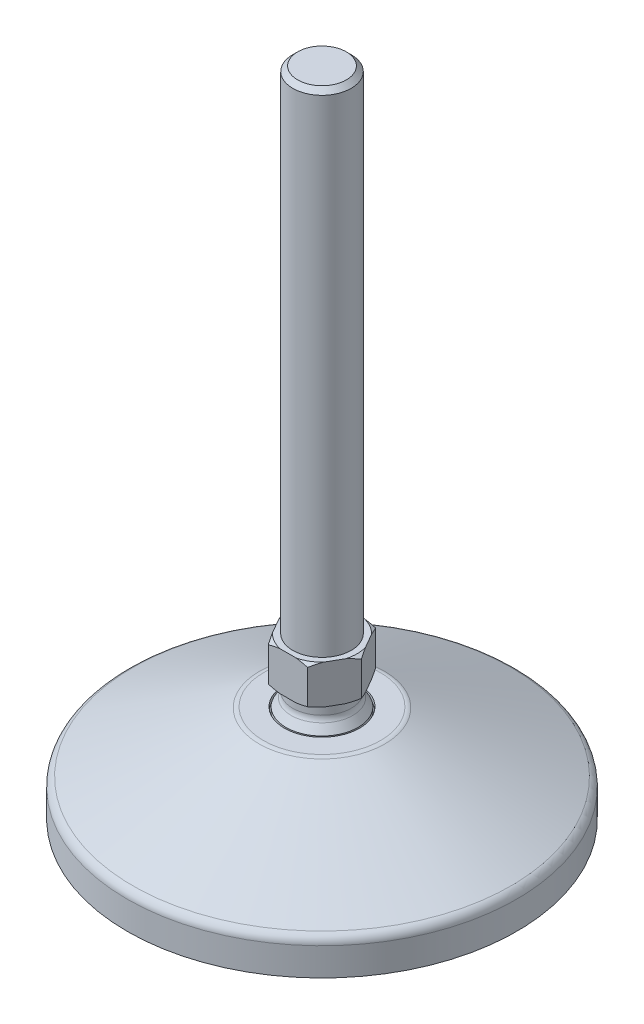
ISO-10303-21;
HEADER;
FILE_DESCRIPTION(('STEP AP214'),'2;1');
FILE_NAME('part.step','',(''),(''),'','','');
FILE_SCHEMA(('AUTOMOTIVE_DESIGN { 1 0 10303 214 1 1 1 1 }'));
ENDSEC;
DATA;
#1=APPLICATION_CONTEXT('core data for automotive mechanical design processes');
#2=APPLICATION_PROTOCOL_DEFINITION('international standard','automotive_design',2000,#1);
#3=PRODUCT_CONTEXT('',#1,'mechanical');
#4=PRODUCT('Part','Part','',(#3));
#5=PRODUCT_RELATED_PRODUCT_CATEGORY('part','',(#4));
#6=PRODUCT_DEFINITION_FORMATION('','',#4);
#7=PRODUCT_DEFINITION_CONTEXT('part definition',#1,'design');
#8=PRODUCT_DEFINITION('design','',#6,#7);
#9=PRODUCT_DEFINITION_SHAPE('','',#8);
#10=(LENGTH_UNIT() NAMED_UNIT(*) SI_UNIT(.MILLI.,.METRE.));
#11=(NAMED_UNIT(*) PLANE_ANGLE_UNIT() SI_UNIT($,.RADIAN.));
#12=(NAMED_UNIT(*) SI_UNIT($,.STERADIAN.) SOLID_ANGLE_UNIT());
#13=UNCERTAINTY_MEASURE_WITH_UNIT(LENGTH_MEASURE(1.E-05),#10,'distance_accuracy_value','');
#14=(GEOMETRIC_REPRESENTATION_CONTEXT(3) GLOBAL_UNCERTAINTY_ASSIGNED_CONTEXT((#13)) GLOBAL_UNIT_ASSIGNED_CONTEXT((#10,
#11,#12)) REPRESENTATION_CONTEXT('',''));
#15=CARTESIAN_POINT('',(0.,0.,0.));
#16=DIRECTION('',(0.,0.,1.));
#17=DIRECTION('',(1.,0.,0.));
#18=AXIS2_PLACEMENT_3D('',#15,#16,#17);
#19=CARTESIAN_POINT('',(0.,0.,0.));
#20=DIRECTION('',(0.,1.,0.));
#21=DIRECTION('',(0.,0.,1.));
#22=AXIS2_PLACEMENT_3D('',#19,#20,#21);
#23=PLANE('',#22);
#24=CARTESIAN_POINT('',(0.,0.,0.));
#25=DIRECTION('',(0.,-1.,0.));
#26=DIRECTION('',(0.,0.,-1.));
#27=AXIS2_PLACEMENT_3D('',#24,#25,#26);
#28=CIRCLE('',#27,31.5);
#29=CARTESIAN_POINT('',(-4.13114754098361,0.,31.227930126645));
#30=VERTEX_POINT('',#29);
#31=CARTESIAN_POINT('',(-30.6591619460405,0.,7.22950819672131));
#32=VERTEX_POINT('',#31);
#33=EDGE_CURVE('E658',#30,#32,#28,.T.);
#34=ORIENTED_EDGE('',*,*,#33,.F.);
#35=CARTESIAN_POINT('',(-4.,0.,30.2365672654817));
#36=DIRECTION('',(0.,1.,0.));
#37=DIRECTION('',(0.,0.,1.));
#38=AXIS2_PLACEMENT_3D('',#35,#36,#37);
#39=CIRCLE('',#38,1.);
#40=CARTESIAN_POINT('',(-3.,0.,30.2365672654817));
#41=VERTEX_POINT('',#40);
#42=EDGE_CURVE('E838',#30,#41,#39,.T.);
#43=ORIENTED_EDGE('',*,*,#42,.T.);
#44=DIRECTION('',(0.,0.,1.));
#45=VECTOR('',#44,1.);
#46=CARTESIAN_POINT('',(-3.,0.,6.));
#47=LINE('',#46,#45);
#48=CARTESIAN_POINT('',(-3.,0.,7.));
#49=VERTEX_POINT('',#48);
#50=EDGE_CURVE('E649',#49,#41,#47,.T.);
#51=ORIENTED_EDGE('',*,*,#50,.F.);
#52=CARTESIAN_POINT('',(-4.,0.,7.));
#53=DIRECTION('',(0.,1.,0.));
#54=DIRECTION('',(0.,0.,1.));
#55=AXIS2_PLACEMENT_3D('',#52,#53,#54);
#56=CIRCLE('',#55,1.);
#57=CARTESIAN_POINT('',(-4.,0.,6.));
#58=VERTEX_POINT('',#57);
#59=EDGE_CURVE('E841',#49,#58,#56,.T.);
#60=ORIENTED_EDGE('',*,*,#59,.T.);
#61=DIRECTION('',(1.,0.,0.));
#62=VECTOR('',#61,1.);
#63=CARTESIAN_POINT('',(-30.9232921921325,0.,6.));
#64=LINE('',#63,#62);
#65=CARTESIAN_POINT('',(-29.6858552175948,0.,6.));
#66=VERTEX_POINT('',#65);
#67=EDGE_CURVE('E654',#66,#58,#64,.T.);
#68=ORIENTED_EDGE('',*,*,#67,.F.);
#69=CARTESIAN_POINT('',(-29.6858552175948,0.,7.));
#70=DIRECTION('',(0.,1.,0.));
#71=DIRECTION('',(0.,0.,1.));
#72=AXIS2_PLACEMENT_3D('',#69,#70,#71);
#73=CIRCLE('',#72,1.);
#74=EDGE_CURVE('E844',#66,#32,#73,.T.);
#75=ORIENTED_EDGE('',*,*,#74,.T.);
#76=EDGE_LOOP('',(#34,#43,#51,#60,#68,#75));
#77=FACE_BOUND('',#76,.T.);
#78=CARTESIAN_POINT('',(0.,0.,0.));
#79=DIRECTION('',(0.,1.,0.));
#80=DIRECTION('',(0.,0.,1.));
#81=AXIS2_PLACEMENT_3D('',#78,#79,#80);
#82=CIRCLE('',#81,35.);
#83=CARTESIAN_POINT('',(0.,0.,35.));
#84=VERTEX_POINT('',#83);
#85=EDGE_CURVE('E385',#84,#84,#82,.T.);
#86=ORIENTED_EDGE('',*,*,#85,.F.);
#87=EDGE_LOOP('',(#86));
#88=FACE_BOUND('',#87,.T.);
#89=DIRECTION('',(0.,0.,-1.));
#90=VECTOR('',#89,1.);
#91=CARTESIAN_POINT('',(3.,0.,6.));
#92=LINE('',#91,#90);
#93=CARTESIAN_POINT('',(3.,0.,30.2365672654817));
#94=VERTEX_POINT('',#93);
#95=CARTESIAN_POINT('',(3.,0.,7.));
#96=VERTEX_POINT('',#95);
#97=EDGE_CURVE('E610',#94,#96,#92,.T.);
#98=ORIENTED_EDGE('',*,*,#97,.F.);
#99=CARTESIAN_POINT('',(4.,0.,30.2365672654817));
#100=DIRECTION('',(0.,1.,0.));
#101=DIRECTION('',(0.,0.,1.));
#102=AXIS2_PLACEMENT_3D('',#99,#100,#101);
#103=CIRCLE('',#102,1.);
#104=CARTESIAN_POINT('',(4.13114754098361,0.,31.227930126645));
#105=VERTEX_POINT('',#104);
#106=EDGE_CURVE('E832',#94,#105,#103,.T.);
#107=ORIENTED_EDGE('',*,*,#106,.T.);
#108=CARTESIAN_POINT('',(0.,0.,0.));
#109=DIRECTION('',(0.,-1.,0.));
#110=DIRECTION('',(0.,0.,-1.));
#111=AXIS2_PLACEMENT_3D('',#108,#109,#110);
#112=CIRCLE('',#111,31.5);
#113=CARTESIAN_POINT('',(30.6591619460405,0.,7.22950819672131));
#114=VERTEX_POINT('',#113);
#115=EDGE_CURVE('E601',#114,#105,#112,.T.);
#116=ORIENTED_EDGE('',*,*,#115,.F.);
#117=CARTESIAN_POINT('',(29.6858552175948,0.,7.));
#118=DIRECTION('',(0.,1.,0.));
#119=DIRECTION('',(0.,0.,1.));
#120=AXIS2_PLACEMENT_3D('',#117,#118,#119);
#121=CIRCLE('',#120,1.);
#122=CARTESIAN_POINT('',(29.6858552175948,0.,6.));
#123=VERTEX_POINT('',#122);
#124=EDGE_CURVE('E829',#114,#123,#121,.T.);
#125=ORIENTED_EDGE('',*,*,#124,.T.);
#126=DIRECTION('',(1.,0.,0.));
#127=VECTOR('',#126,1.);
#128=CARTESIAN_POINT('',(3.,0.,6.));
#129=LINE('',#128,#127);
#130=CARTESIAN_POINT('',(4.,0.,6.));
#131=VERTEX_POINT('',#130);
#132=EDGE_CURVE('E606',#131,#123,#129,.T.);
#133=ORIENTED_EDGE('',*,*,#132,.F.);
#134=CARTESIAN_POINT('',(4.,0.,7.));
#135=DIRECTION('',(0.,1.,0.));
#136=DIRECTION('',(0.,0.,1.));
#137=AXIS2_PLACEMENT_3D('',#134,#135,#136);
#138=CIRCLE('',#137,1.);
#139=EDGE_CURVE('E835',#131,#96,#138,.T.);
#140=ORIENTED_EDGE('',*,*,#139,.T.);
#141=EDGE_LOOP('',(#98,#107,#116,#125,#133,#140));
#142=FACE_BOUND('',#141,.T.);
#143=CARTESIAN_POINT('',(0.,0.,0.));
#144=DIRECTION('',(0.,-1.,0.));
#145=DIRECTION('',(0.,0.,-1.));
#146=AXIS2_PLACEMENT_3D('',#143,#144,#145);
#147=CIRCLE('',#146,31.5);
#148=CARTESIAN_POINT('',(-30.6591619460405,0.,-7.22950819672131));
#149=VERTEX_POINT('',#148);
#150=CARTESIAN_POINT('',(-4.13114754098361,0.,-31.227930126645));
#151=VERTEX_POINT('',#150);
#152=EDGE_CURVE('E634',#149,#151,#147,.T.);
#153=ORIENTED_EDGE('',*,*,#152,.F.);
#154=CARTESIAN_POINT('',(-29.6858552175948,0.,-7.));
#155=DIRECTION('',(0.,1.,0.));
#156=DIRECTION('',(0.,0.,1.));
#157=AXIS2_PLACEMENT_3D('',#154,#155,#156);
#158=CIRCLE('',#157,1.);
#159=CARTESIAN_POINT('',(-29.6858552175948,0.,-6.));
#160=VERTEX_POINT('',#159);
#161=EDGE_CURVE('E847',#149,#160,#158,.T.);
#162=ORIENTED_EDGE('',*,*,#161,.T.);
#163=DIRECTION('',(-1.,0.,0.));
#164=VECTOR('',#163,1.);
#165=CARTESIAN_POINT('',(-30.9232921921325,0.,-6.));
#166=LINE('',#165,#164);
#167=CARTESIAN_POINT('',(-4.,0.,-6.));
#168=VERTEX_POINT('',#167);
#169=EDGE_CURVE('E626',#168,#160,#166,.T.);
#170=ORIENTED_EDGE('',*,*,#169,.F.);
#171=CARTESIAN_POINT('',(-4.,0.,-7.));
#172=DIRECTION('',(0.,1.,0.));
#173=DIRECTION('',(0.,0.,1.));
#174=AXIS2_PLACEMENT_3D('',#171,#172,#173);
#175=CIRCLE('',#174,1.);
#176=CARTESIAN_POINT('',(-3.,0.,-7.));
#177=VERTEX_POINT('',#176);
#178=EDGE_CURVE('E12',#168,#177,#175,.T.);
#179=ORIENTED_EDGE('',*,*,#178,.T.);
#180=DIRECTION('',(0.,0.,1.));
#181=VECTOR('',#180,1.);
#182=CARTESIAN_POINT('',(-3.,0.,-31.3568174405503));
#183=LINE('',#182,#181);
#184=CARTESIAN_POINT('',(-3.,0.,-30.2365672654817));
#185=VERTEX_POINT('',#184);
#186=EDGE_CURVE('E631',#185,#177,#183,.T.);
#187=ORIENTED_EDGE('',*,*,#186,.F.);
#188=CARTESIAN_POINT('',(-4.,0.,-30.2365672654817));
#189=DIRECTION('',(0.,1.,0.));
#190=DIRECTION('',(0.,0.,1.));
#191=AXIS2_PLACEMENT_3D('',#188,#189,#190);
#192=CIRCLE('',#191,1.);
#193=EDGE_CURVE('E66',#185,#151,#192,.T.);
#194=ORIENTED_EDGE('',*,*,#193,.T.);
#195=EDGE_LOOP('',(#153,#162,#170,#179,#187,#194));
#196=FACE_BOUND('',#195,.T.);
#197=CARTESIAN_POINT('',(0.,0.,0.));
#198=DIRECTION('',(0.,-1.,0.));
#199=DIRECTION('',(0.,0.,-1.));
#200=AXIS2_PLACEMENT_3D('',#197,#198,#199);
#201=CIRCLE('',#200,31.5);
#202=CARTESIAN_POINT('',(4.13114754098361,0.,-31.227930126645));
#203=VERTEX_POINT('',#202);
#204=CARTESIAN_POINT('',(30.6591619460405,0.,-7.22950819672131));
#205=VERTEX_POINT('',#204);
#206=EDGE_CURVE('E682',#203,#205,#201,.T.);
#207=ORIENTED_EDGE('',*,*,#206,.F.);
#208=CARTESIAN_POINT('',(4.,0.,-30.2365672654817));
#209=DIRECTION('',(0.,1.,0.));
#210=DIRECTION('',(0.,0.,1.));
#211=AXIS2_PLACEMENT_3D('',#208,#209,#210);
#212=CIRCLE('',#211,1.);
#213=CARTESIAN_POINT('',(3.,0.,-30.2365672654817));
#214=VERTEX_POINT('',#213);
#215=EDGE_CURVE('E820',#203,#214,#212,.T.);
#216=ORIENTED_EDGE('',*,*,#215,.T.);
#217=DIRECTION('',(0.,0.,-1.));
#218=VECTOR('',#217,1.);
#219=CARTESIAN_POINT('',(3.,0.,-31.3568174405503));
#220=LINE('',#219,#218);
#221=CARTESIAN_POINT('',(3.,0.,-7.));
#222=VERTEX_POINT('',#221);
#223=EDGE_CURVE('E673',#222,#214,#220,.T.);
#224=ORIENTED_EDGE('',*,*,#223,.F.);
#225=CARTESIAN_POINT('',(4.,0.,-7.));
#226=DIRECTION('',(0.,1.,0.));
#227=DIRECTION('',(0.,0.,1.));
#228=AXIS2_PLACEMENT_3D('',#225,#226,#227);
#229=CIRCLE('',#228,1.);
#230=CARTESIAN_POINT('',(4.,0.,-6.));
#231=VERTEX_POINT('',#230);
#232=EDGE_CURVE('E823',#222,#231,#229,.T.);
#233=ORIENTED_EDGE('',*,*,#232,.T.);
#234=DIRECTION('',(-1.,0.,0.));
#235=VECTOR('',#234,1.);
#236=CARTESIAN_POINT('',(3.,0.,-6.));
#237=LINE('',#236,#235);
#238=CARTESIAN_POINT('',(29.6858552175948,0.,-6.));
#239=VERTEX_POINT('',#238);
#240=EDGE_CURVE('E678',#239,#231,#237,.T.);
#241=ORIENTED_EDGE('',*,*,#240,.F.);
#242=CARTESIAN_POINT('',(29.6858552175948,0.,-7.));
#243=DIRECTION('',(0.,1.,0.));
#244=DIRECTION('',(0.,0.,1.));
#245=AXIS2_PLACEMENT_3D('',#242,#243,#244);
#246=CIRCLE('',#245,1.);
#247=EDGE_CURVE('E826',#239,#205,#246,.T.);
#248=ORIENTED_EDGE('',*,*,#247,.T.);
#249=EDGE_LOOP('',(#207,#216,#224,#233,#241,#248));
#250=FACE_BOUND('',#249,.T.);
#251=ADVANCED_FACE('F57',(#77,#88,#142,#196,#250),#23,.F.);
#252=CARTESIAN_POINT('',(0.,35.,0.));
#253=DIRECTION('',(0.,1.,0.));
#254=DIRECTION('',(0.,0.,1.));
#255=AXIS2_PLACEMENT_3D('',#252,#253,#254);
#256=PLANE('',#255);
#257=CARTESIAN_POINT('',(0.,35.,0.));
#258=DIRECTION('',(0.,1.,0.));
#259=DIRECTION('',(0.,0.,1.));
#260=AXIS2_PLACEMENT_3D('',#257,#258,#259);
#261=CIRCLE('',#260,6.);
#262=CARTESIAN_POINT('',(0.,35.,6.));
#263=VERTEX_POINT('',#262);
#264=EDGE_CURVE('E504',#263,#263,#261,.T.);
#265=ORIENTED_EDGE('',*,*,#264,.F.);
#266=EDGE_LOOP('',(#265));
#267=FACE_BOUND('',#266,.T.);
#268=CARTESIAN_POINT('',(0.,35.,0.));
#269=DIRECTION('',(0.,1.,0.));
#270=DIRECTION('',(0.,0.,1.));
#271=AXIS2_PLACEMENT_3D('',#268,#269,#270);
#272=CIRCLE('',#271,7.2);
#273=CARTESIAN_POINT('',(-5.21956284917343,35.,4.95945195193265));
#274=VERTEX_POINT('',#273);
#275=CARTESIAN_POINT('',(-1.68522995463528,35.,7.));
#276=VERTEX_POINT('',#275);
#277=EDGE_CURVE('E595',#274,#276,#272,.T.);
#278=ORIENTED_EDGE('',*,*,#277,.T.);
#279=DIRECTION('',(1.,0.,0.));
#280=VECTOR('',#279,1.);
#281=CARTESIAN_POINT('',(-4.04145188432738,35.,7.));
#282=LINE('',#281,#280);
#283=CARTESIAN_POINT('',(1.68522995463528,35.,7.));
#284=VERTEX_POINT('',#283);
#285=EDGE_CURVE('E530',#276,#284,#282,.T.);
#286=ORIENTED_EDGE('',*,*,#285,.T.);
#287=CARTESIAN_POINT('',(5.21956284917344,35.,4.95945195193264));
#288=VERTEX_POINT('',#287);
#289=EDGE_CURVE('E596',#284,#288,#272,.T.);
#290=ORIENTED_EDGE('',*,*,#289,.T.);
#291=DIRECTION('',(0.5,0.,-0.866025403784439));
#292=VECTOR('',#291,1.);
#293=CARTESIAN_POINT('',(4.04145188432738,35.,7.));
#294=LINE('',#293,#292);
#295=CARTESIAN_POINT('',(6.90479280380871,35.,2.04054804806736));
#296=VERTEX_POINT('',#295);
#297=EDGE_CURVE('E509',#288,#296,#294,.T.);
#298=ORIENTED_EDGE('',*,*,#297,.T.);
#299=CARTESIAN_POINT('',(6.90479280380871,35.,-2.04054804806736));
#300=VERTEX_POINT('',#299);
#301=EDGE_CURVE('E600',#296,#300,#272,.T.);
#302=ORIENTED_EDGE('',*,*,#301,.T.);
#303=DIRECTION('',(-0.5,0.,-0.866025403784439));
#304=VECTOR('',#303,1.);
#305=CARTESIAN_POINT('',(8.08290376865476,35.,0.));
#306=LINE('',#305,#304);
#307=CARTESIAN_POINT('',(5.21956284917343,35.,-4.95945195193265));
#308=VERTEX_POINT('',#307);
#309=EDGE_CURVE('E513',#300,#308,#306,.T.);
#310=ORIENTED_EDGE('',*,*,#309,.T.);
#311=CARTESIAN_POINT('',(1.68522995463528,35.,-7.));
#312=VERTEX_POINT('',#311);
#313=EDGE_CURVE('E1698',#308,#312,#272,.T.);
#314=ORIENTED_EDGE('',*,*,#313,.T.);
#315=DIRECTION('',(-1.,0.,0.));
#316=VECTOR('',#315,1.);
#317=CARTESIAN_POINT('',(4.04145188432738,35.,-7.));
#318=LINE('',#317,#316);
#319=CARTESIAN_POINT('',(-1.68522995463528,35.,-7.));
#320=VERTEX_POINT('',#319);
#321=EDGE_CURVE('E518',#312,#320,#318,.T.);
#322=ORIENTED_EDGE('',*,*,#321,.T.);
#323=CARTESIAN_POINT('',(-5.21956284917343,35.,-4.95945195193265));
#324=VERTEX_POINT('',#323);
#325=EDGE_CURVE('E1701',#320,#324,#272,.T.);
#326=ORIENTED_EDGE('',*,*,#325,.T.);
#327=DIRECTION('',(-0.5,0.,0.866025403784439));
#328=VECTOR('',#327,1.);
#329=CARTESIAN_POINT('',(-4.04145188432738,35.,-7.));
#330=LINE('',#329,#328);
#331=CARTESIAN_POINT('',(-6.90479280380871,35.,-2.04054804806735));
#332=VERTEX_POINT('',#331);
#333=EDGE_CURVE('E522',#324,#332,#330,.T.);
#334=ORIENTED_EDGE('',*,*,#333,.T.);
#335=CARTESIAN_POINT('',(-6.90479280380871,35.,2.04054804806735));
#336=VERTEX_POINT('',#335);
#337=EDGE_CURVE('E1704',#332,#336,#272,.T.);
#338=ORIENTED_EDGE('',*,*,#337,.T.);
#339=DIRECTION('',(0.5,0.,0.866025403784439));
#340=VECTOR('',#339,1.);
#341=CARTESIAN_POINT('',(-8.08290376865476,35.,0.));
#342=LINE('',#341,#340);
#343=EDGE_CURVE('E526',#336,#274,#342,.T.);
#344=ORIENTED_EDGE('',*,*,#343,.T.);
#345=EDGE_LOOP('',(#278,#286,#290,#298,#302,#310,#314,#322,#326,#334,#338,#344));
#346=FACE_BOUND('',#345,.T.);
#347=ADVANCED_FACE('F428',(#267,#346),#256,.T.);
#348=CARTESIAN_POINT('',(0.,27.,0.));
#349=DIRECTION('',(0.,1.,0.));
#350=DIRECTION('',(0.,0.,1.));
#351=AXIS2_PLACEMENT_3D('',#348,#349,#350);
#352=PLANE('',#351);
#353=CARTESIAN_POINT('',(0.,27.,0.));
#354=DIRECTION('',(0.,1.,0.));
#355=DIRECTION('',(0.,0.,1.));
#356=AXIS2_PLACEMENT_3D('',#353,#354,#355);
#357=CIRCLE('',#356,6.);
#358=CARTESIAN_POINT('',(0.,27.,6.));
#359=VERTEX_POINT('',#358);
#360=EDGE_CURVE('E390',#359,#359,#357,.T.);
#361=ORIENTED_EDGE('',*,*,#360,.T.);
#362=EDGE_LOOP('',(#361));
#363=FACE_BOUND('',#362,.T.);
#364=DIRECTION('',(1.,0.,0.));
#365=VECTOR('',#364,1.);
#366=CARTESIAN_POINT('',(-4.04145188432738,27.,7.));
#367=LINE('',#366,#365);
#368=CARTESIAN_POINT('',(-1.68522995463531,27.,7.));
#369=VERTEX_POINT('',#368);
#370=CARTESIAN_POINT('',(1.68522995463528,27.,7.));
#371=VERTEX_POINT('',#370);
#372=EDGE_CURVE('E514',#369,#371,#367,.T.);
#373=ORIENTED_EDGE('',*,*,#372,.F.);
#374=CARTESIAN_POINT('',(0.,27.,0.));
#375=DIRECTION('',(0.,1.,0.));
#376=DIRECTION('',(0.,0.,1.));
#377=AXIS2_PLACEMENT_3D('',#374,#375,#376);
#378=CIRCLE('',#377,7.2);
#379=CARTESIAN_POINT('',(-5.21956284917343,27.,4.95945195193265));
#380=VERTEX_POINT('',#379);
#381=EDGE_CURVE('E591',#380,#369,#378,.T.);
#382=ORIENTED_EDGE('',*,*,#381,.F.);
#383=DIRECTION('',(0.5,0.,0.866025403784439));
#384=VECTOR('',#383,1.);
#385=CARTESIAN_POINT('',(-8.08290376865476,27.,0.));
#386=LINE('',#385,#384);
#387=CARTESIAN_POINT('',(-6.90479280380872,27.,2.04054804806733));
#388=VERTEX_POINT('',#387);
#389=EDGE_CURVE('E548',#388,#380,#386,.T.);
#390=ORIENTED_EDGE('',*,*,#389,.F.);
#391=CARTESIAN_POINT('',(-6.90479280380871,27.,-2.04054804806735));
#392=VERTEX_POINT('',#391);
#393=EDGE_CURVE('E588',#392,#388,#378,.T.);
#394=ORIENTED_EDGE('',*,*,#393,.F.);
#395=DIRECTION('',(-0.5,0.,0.866025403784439));
#396=VECTOR('',#395,1.);
#397=CARTESIAN_POINT('',(-4.04145188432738,27.,-7.));
#398=LINE('',#397,#396);
#399=CARTESIAN_POINT('',(-5.21956284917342,27.,-4.95945195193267));
#400=VERTEX_POINT('',#399);
#401=EDGE_CURVE('E544',#400,#392,#398,.T.);
#402=ORIENTED_EDGE('',*,*,#401,.F.);
#403=CARTESIAN_POINT('',(-1.68522995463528,27.,-7.));
#404=VERTEX_POINT('',#403);
#405=EDGE_CURVE('E580',#404,#400,#378,.T.);
#406=ORIENTED_EDGE('',*,*,#405,.F.);
#407=DIRECTION('',(-1.,0.,0.));
#408=VECTOR('',#407,1.);
#409=CARTESIAN_POINT('',(4.04145188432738,27.,-7.));
#410=LINE('',#409,#408);
#411=CARTESIAN_POINT('',(1.6852299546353,27.,-7.));
#412=VERTEX_POINT('',#411);
#413=EDGE_CURVE('E540',#412,#404,#410,.T.);
#414=ORIENTED_EDGE('',*,*,#413,.F.);
#415=CARTESIAN_POINT('',(5.21956284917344,27.,-4.95945195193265));
#416=VERTEX_POINT('',#415);
#417=EDGE_CURVE('E587',#416,#412,#378,.T.);
#418=ORIENTED_EDGE('',*,*,#417,.F.);
#419=DIRECTION('',(-0.5,0.,-0.866025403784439));
#420=VECTOR('',#419,1.);
#421=CARTESIAN_POINT('',(8.08290376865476,27.,0.));
#422=LINE('',#421,#420);
#423=CARTESIAN_POINT('',(6.90479280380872,27.,-2.04054804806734));
#424=VERTEX_POINT('',#423);
#425=EDGE_CURVE('E537',#424,#416,#422,.T.);
#426=ORIENTED_EDGE('',*,*,#425,.F.);
#427=CARTESIAN_POINT('',(6.90479280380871,27.,2.04054804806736));
#428=VERTEX_POINT('',#427);
#429=EDGE_CURVE('E330',#428,#424,#378,.T.);
#430=ORIENTED_EDGE('',*,*,#429,.F.);
#431=DIRECTION('',(0.5,0.,-0.866025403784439));
#432=VECTOR('',#431,1.);
#433=CARTESIAN_POINT('',(4.04145188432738,27.,7.));
#434=LINE('',#433,#432);
#435=CARTESIAN_POINT('',(5.21956284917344,27.,4.95945195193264));
#436=VERTEX_POINT('',#435);
#437=EDGE_CURVE('E346',#436,#428,#434,.T.);
#438=ORIENTED_EDGE('',*,*,#437,.F.);
#439=EDGE_CURVE('E592',#371,#436,#378,.T.);
#440=ORIENTED_EDGE('',*,*,#439,.F.);
#441=EDGE_LOOP('',(#373,#382,#390,#394,#402,#406,#414,#418,#426,#430,#438,#440));
#442=FACE_BOUND('',#441,.T.);
#443=ADVANCED_FACE('F583',(#363,#442),#352,.F.);
#444=CARTESIAN_POINT('',(0.,27.,0.));
#445=DIRECTION('',(0.,-1.,0.));
#446=DIRECTION('',(0.,0.,-1.));
#447=AXIS2_PLACEMENT_3D('',#444,#445,#446);
#448=CYLINDRICAL_SURFACE('',#447,6.);
#449=CARTESIAN_POINT('',(0.,24.705551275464,0.));
#450=DIRECTION('',(0.,1.,0.));
#451=DIRECTION('',(0.,0.,1.));
#452=AXIS2_PLACEMENT_3D('',#449,#450,#451);
#453=CIRCLE('',#452,6.);
#454=CARTESIAN_POINT('',(0.,24.705551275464,6.));
#455=VERTEX_POINT('',#454);
#456=EDGE_CURVE('E1730',#455,#455,#453,.T.);
#457=ORIENTED_EDGE('',*,*,#456,.T.);
#458=EDGE_LOOP('',(#457));
#459=FACE_BOUND('',#458,.T.);
#460=ORIENTED_EDGE('',*,*,#360,.F.);
#461=EDGE_LOOP('',(#460));
#462=FACE_BOUND('',#461,.T.);
#463=ADVANCED_FACE('F1406',(#459,#462),#448,.T.);
#464=CARTESIAN_POINT('',(0.,22.,0.));
#465=DIRECTION('',(0.,1.,0.));
#466=DIRECTION('',(0.,0.,1.));
#467=AXIS2_PLACEMENT_3D('',#464,#465,#466);
#468=PLANE('',#467);
#469=CARTESIAN_POINT('',(0.,22.,0.));
#470=DIRECTION('',(0.,1.,0.));
#471=DIRECTION('',(0.,0.,1.));
#472=AXIS2_PLACEMENT_3D('',#469,#470,#471);
#473=CIRCLE('',#472,12.05108886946);
#474=CARTESIAN_POINT('',(0.,22.,12.05108886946));
#475=VERTEX_POINT('',#474);
#476=EDGE_CURVE('E1727',#475,#475,#473,.T.);
#477=ORIENTED_EDGE('',*,*,#476,.T.);
#478=EDGE_LOOP('',(#477));
#479=FACE_BOUND('',#478,.T.);
#480=CARTESIAN_POINT('',(0.,22.,0.));
#481=DIRECTION('',(0.,1.,0.));
#482=DIRECTION('',(0.,0.,1.));
#483=AXIS2_PLACEMENT_3D('',#480,#481,#482);
#484=CIRCLE('',#483,7.7);
#485=CARTESIAN_POINT('',(0.,22.,7.7));
#486=VERTEX_POINT('',#485);
#487=EDGE_CURVE('E372',#486,#486,#484,.T.);
#488=ORIENTED_EDGE('',*,*,#487,.F.);
#489=EDGE_LOOP('',(#488));
#490=FACE_BOUND('',#489,.T.);
#491=ADVANCED_FACE('F900',(#479,#490),#468,.T.);
#492=CARTESIAN_POINT('',(0.,2.,0.));
#493=DIRECTION('',(0.,-1.,0.));
#494=DIRECTION('',(0.,0.,-1.));
#495=AXIS2_PLACEMENT_3D('',#492,#493,#494);
#496=CYLINDRICAL_SURFACE('',#495,35.);
#497=CARTESIAN_POINT('',(0.,2.,0.));
#498=DIRECTION('',(0.,1.,0.));
#499=DIRECTION('',(0.,0.,1.));
#500=AXIS2_PLACEMENT_3D('',#497,#498,#499);
#501=CIRCLE('',#500,35.);
#502=CARTESIAN_POINT('',(0.,2.,35.));
#503=VERTEX_POINT('',#502);
#504=EDGE_CURVE('E386',#503,#503,#501,.T.);
#505=ORIENTED_EDGE('',*,*,#504,.F.);
#506=EDGE_LOOP('',(#505));
#507=FACE_BOUND('',#506,.T.);
#508=ORIENTED_EDGE('',*,*,#85,.T.);
#509=EDGE_LOOP('',(#508));
#510=FACE_BOUND('',#509,.T.);
#511=ADVANCED_FACE('F897',(#507,#510),#496,.T.);
#512=CARTESIAN_POINT('',(0.,9.,0.));
#513=DIRECTION('',(0.,-1.,0.));
#514=DIRECTION('',(0.,0.,-1.));
#515=AXIS2_PLACEMENT_3D('',#512,#513,#514);
#516=CYLINDRICAL_SURFACE('',#515,40.);
#517=CARTESIAN_POINT('',(0.,7.73324201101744,0.));
#518=DIRECTION('',(0.,-1.,0.));
#519=DIRECTION('',(0.,0.,-1.));
#520=AXIS2_PLACEMENT_3D('',#517,#518,#519);
#521=CIRCLE('',#520,40.);
#522=CARTESIAN_POINT('',(0.,7.73324201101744,-40.));
#523=VERTEX_POINT('',#522);
#524=EDGE_CURVE('E1723',#523,#523,#521,.T.);
#525=ORIENTED_EDGE('',*,*,#524,.T.);
#526=EDGE_LOOP('',(#525));
#527=FACE_BOUND('',#526,.T.);
#528=CARTESIAN_POINT('',(0.,2.,0.));
#529=DIRECTION('',(0.,1.,0.));
#530=DIRECTION('',(0.,0.,1.));
#531=AXIS2_PLACEMENT_3D('',#528,#529,#530);
#532=CIRCLE('',#531,40.);
#533=CARTESIAN_POINT('',(0.,2.,40.));
#534=VERTEX_POINT('',#533);
#535=EDGE_CURVE('E378',#534,#534,#532,.T.);
#536=ORIENTED_EDGE('',*,*,#535,.T.);
#537=EDGE_LOOP('',(#536));
#538=FACE_BOUND('',#537,.T.);
#539=ADVANCED_FACE('F895',(#527,#538),#516,.T.);
#540=CARTESIAN_POINT('',(0.,2.,0.));
#541=DIRECTION('',(0.,1.,0.));
#542=DIRECTION('',(0.,0.,1.));
#543=AXIS2_PLACEMENT_3D('',#540,#541,#542);
#544=PLANE('',#543);
#545=ORIENTED_EDGE('',*,*,#504,.T.);
#546=EDGE_LOOP('',(#545));
#547=FACE_BOUND('',#546,.T.);
#548=ORIENTED_EDGE('',*,*,#535,.F.);
#549=EDGE_LOOP('',(#548));
#550=FACE_BOUND('',#549,.T.);
#551=ADVANCED_FACE('F1561',(#547,#550),#544,.F.);
#552=CARTESIAN_POINT('',(0.,22.,0.));
#553=DIRECTION('',(0.,-1.,0.));
#554=DIRECTION('',(0.,0.,-1.));
#555=AXIS2_PLACEMENT_3D('',#552,#553,#554);
#556=CONICAL_SURFACE('',#555,12.5,1.12920396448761);
#557=CARTESIAN_POINT('',(0.,9.54138654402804,0.));
#558=DIRECTION('',(0.,-1.,0.));
#559=DIRECTION('',(0.,0.,-1.));
#560=AXIS2_PLACEMENT_3D('',#557,#558,#559);
#561=CIRCLE('',#560,38.8547592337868);
#562=CARTESIAN_POINT('',(0.,9.54138654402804,-38.8547592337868));
#563=VERTEX_POINT('',#562);
#564=EDGE_CURVE('E1719',#563,#563,#561,.F.);
#565=CARTESIAN_POINT('',(0.,21.8081445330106,0.));
#566=DIRECTION('',(0.,1.,0.));
#567=DIRECTION('',(0.,0.,1.));
#568=AXIS2_PLACEMENT_3D('',#565,#566,#567);
#569=CIRCLE('',#568,12.9058481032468);
#570=CARTESIAN_POINT('',(0.,21.8081445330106,-12.9058481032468));
#571=VERTEX_POINT('',#570);
#572=EDGE_CURVE('E1713',#571,#571,#569,.F.);
#573=CARTESIAN_POINT('',(0.,9.54138654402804,-38.8547592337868));
#574=CARTESIAN_POINT('',(0.,9.66916527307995,-38.584458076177));
#575=CARTESIAN_POINT('',(0.,9.79694400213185,-38.3141569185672));
#576=CARTESIAN_POINT('',(0.,10.0525014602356,-37.7735546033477));
#577=CARTESIAN_POINT('',(0.,10.1802801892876,-37.5032534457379));
#578=CARTESIAN_POINT('',(0.,10.4358376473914,-36.9626511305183));
#579=CARTESIAN_POINT('',(0.,10.5636163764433,-36.6923499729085));
#580=CARTESIAN_POINT('',(0.,10.8191738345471,-36.1517476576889));
#581=CARTESIAN_POINT('',(0.,10.946952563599,-35.8814465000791));
#582=CARTESIAN_POINT('',(0.,11.2025100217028,-35.3408441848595));
#583=CARTESIAN_POINT('',(0.,11.3302887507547,-35.0705430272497));
#584=CARTESIAN_POINT('',(0.,11.5858462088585,-34.5299407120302));
#585=CARTESIAN_POINT('',(0.,11.7136249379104,-34.2596395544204));
#586=CARTESIAN_POINT('',(0.,11.9691823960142,-33.7190372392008));
#587=CARTESIAN_POINT('',(0.,12.0969611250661,-33.448736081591));
#588=CARTESIAN_POINT('',(0.,12.3525185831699,-32.9081337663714));
#589=CARTESIAN_POINT('',(0.,12.4802973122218,-32.6378326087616));
#590=CARTESIAN_POINT('',(0.,12.7358547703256,-32.097230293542));
#591=CARTESIAN_POINT('',(0.,12.8636334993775,-31.8269291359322));
#592=CARTESIAN_POINT('',(0.,13.1191909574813,-31.2863268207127));
#593=CARTESIAN_POINT('',(0.,13.2469696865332,-31.0160256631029));
#594=CARTESIAN_POINT('',(0.,13.502527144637,-30.4754233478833));
#595=CARTESIAN_POINT('',(0.,13.6303058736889,-30.2051221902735));
#596=CARTESIAN_POINT('',(0.,13.8858633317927,-29.6645198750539));
#597=CARTESIAN_POINT('',(0.,14.0136420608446,-29.3942187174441));
#598=CARTESIAN_POINT('',(0.,14.2691995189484,-28.8536164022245));
#599=CARTESIAN_POINT('',(0.,14.3969782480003,-28.5833152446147));
#600=CARTESIAN_POINT('',(0.,14.6525357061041,-28.0427129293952));
#601=CARTESIAN_POINT('',(0.,14.780314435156,-27.7724117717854));
#602=CARTESIAN_POINT('',(0.,15.0358718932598,-27.2318094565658));
#603=CARTESIAN_POINT('',(0.,15.1636506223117,-26.961508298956));
#604=CARTESIAN_POINT('',(0.,15.4192080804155,-26.4209059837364));
#605=CARTESIAN_POINT('',(0.,15.5469868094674,-26.1506048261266));
#606=CARTESIAN_POINT('',(0.,15.8025442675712,-25.610002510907));
#607=CARTESIAN_POINT('',(0.,15.9303229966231,-25.3397013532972));
#608=CARTESIAN_POINT('',(0.,16.1858804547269,-24.7990990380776));
#609=CARTESIAN_POINT('',(0.,16.3136591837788,-24.5287978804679));
#610=CARTESIAN_POINT('',(0.,16.5692166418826,-23.9881955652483));
#611=CARTESIAN_POINT('',(0.,16.6969953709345,-23.7178944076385));
#612=CARTESIAN_POINT('',(0.,16.9525528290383,-23.1772920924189));
#613=CARTESIAN_POINT('',(0.,17.0803315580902,-22.9069909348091));
#614=CARTESIAN_POINT('',(0.,17.335889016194,-22.3663886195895));
#615=CARTESIAN_POINT('',(0.,17.4636677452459,-22.0960874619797));
#616=CARTESIAN_POINT('',(0.,17.7192252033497,-21.5554851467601));
#617=CARTESIAN_POINT('',(0.,17.8470039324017,-21.2851839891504));
#618=CARTESIAN_POINT('',(0.,18.1025613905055,-20.7445816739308));
#619=CARTESIAN_POINT('',(0.,18.2303401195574,-20.474280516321));
#620=CARTESIAN_POINT('',(0.,18.4858975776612,-19.9336782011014));
#621=CARTESIAN_POINT('',(0.,18.6136763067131,-19.6633770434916));
#622=CARTESIAN_POINT('',(0.,18.8692337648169,-19.122774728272));
#623=CARTESIAN_POINT('',(0.,18.9970124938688,-18.8524735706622));
#624=CARTESIAN_POINT('',(0.,19.2525699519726,-18.3118712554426));
#625=CARTESIAN_POINT('',(0.,19.3803486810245,-18.0415700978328));
#626=CARTESIAN_POINT('',(0.,19.6359061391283,-17.5009677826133));
#627=CARTESIAN_POINT('',(0.,19.7636848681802,-17.2306666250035));
#628=CARTESIAN_POINT('',(0.,20.019242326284,-16.6900643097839));
#629=CARTESIAN_POINT('',(0.,20.1470210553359,-16.4197631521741));
#630=CARTESIAN_POINT('',(0.,20.4025785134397,-15.8791608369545));
#631=CARTESIAN_POINT('',(0.,20.5303572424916,-15.6088596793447));
#632=CARTESIAN_POINT('',(0.,20.7859147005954,-15.0682573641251));
#633=CARTESIAN_POINT('',(0.,20.9136934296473,-14.7979562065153));
#634=CARTESIAN_POINT('',(0.,21.1692508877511,-14.2573538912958));
#635=CARTESIAN_POINT('',(0.,21.297029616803,-13.987052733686));
#636=CARTESIAN_POINT('',(0.,21.5525870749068,-13.4464504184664));
#637=CARTESIAN_POINT('',(0.,21.6803658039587,-13.1761492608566));
#638=CARTESIAN_POINT('',(0.,21.8081445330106,-12.9058481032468));
#639=B_SPLINE_CURVE_WITH_KNOTS('',3,(#573,#574,#575,#576,#577,#578,#579,#580,#581,#582,#583,
#584,#585,#586,#587,#588,#589,#590,#591,#592,#593,#594,#595,#596,#597,#598,#599,#600,#601,#602,
#603,#604,#605,#606,#607,#608,#609,#610,#611,#612,#613,#614,#615,#616,#617,#618,#619,#620,#621,
#622,#623,#624,#625,#626,#627,#628,#629,#630,#631,#632,#633,#634,#635,#636,#637,#638),
.UNSPECIFIED.,.F.,.F.,(4,2,2,2,2,2,2,2,2,2,2,2,2,2,2,2,2,2,2,2,2,2,2,2,2,2,2,2,2,2,2,2,4),(0.,
0.896945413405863,1.79389082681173,2.69083624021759,3.58778165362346,4.48472706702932,
5.38167248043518,6.27861789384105,7.17556330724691,8.07250872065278,8.96945413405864,
9.8663995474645,10.7633449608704,11.6602903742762,12.5572357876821,13.454181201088,
14.3511266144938,15.2480720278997,16.1450174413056,17.0419628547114,17.9389082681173,
18.8358536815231,19.732799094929,20.6297445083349,21.5266899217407,22.4236353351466,
23.3205807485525,24.2175261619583,25.1144715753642,26.0114169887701,26.9083624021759,
27.8053078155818,28.7022532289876),.UNSPECIFIED.);
#640=EDGE_CURVE('BSEAM1553',#563,#571,#639,.T.);
#641=ORIENTED_EDGE('',*,*,#564,.T.);
#642=ORIENTED_EDGE('',*,*,#572,.T.);
#643=ORIENTED_EDGE('',*,*,#640,.T.);
#644=ORIENTED_EDGE('',*,*,#640,.F.);
#645=EDGE_LOOP('',(#641,#643,#642,#644));
#646=FACE_BOUND('',#645,.T.);
#647=ADVANCED_FACE('F1553',(#646),#556,.T.);
#648=CARTESIAN_POINT('',(0.,21.,0.));
#649=DIRECTION('',(0.,1.,0.));
#650=DIRECTION('',(0.,0.,1.));
#651=AXIS2_PLACEMENT_3D('',#648,#649,#650);
#652=CYLINDRICAL_SURFACE('',#651,7.7);
#653=CARTESIAN_POINT('',(0.,21.,0.));
#654=DIRECTION('',(0.,1.,0.));
#655=DIRECTION('',(0.,0.,1.));
#656=AXIS2_PLACEMENT_3D('',#653,#654,#655);
#657=CIRCLE('',#656,7.7);
#658=CARTESIAN_POINT('',(0.,21.,7.7));
#659=VERTEX_POINT('',#658);
#660=EDGE_CURVE('E374',#659,#659,#657,.T.);
#661=ORIENTED_EDGE('',*,*,#660,.F.);
#662=EDGE_LOOP('',(#661));
#663=FACE_BOUND('',#662,.T.);
#664=ORIENTED_EDGE('',*,*,#487,.T.);
#665=EDGE_LOOP('',(#664));
#666=FACE_BOUND('',#665,.T.);
#667=ADVANCED_FACE('F1545',(#663,#666),#652,.F.);
#668=CARTESIAN_POINT('',(0.,21.,0.));
#669=DIRECTION('',(0.,1.,0.));
#670=DIRECTION('',(0.,0.,1.));
#671=AXIS2_PLACEMENT_3D('',#668,#669,#670);
#672=PLANE('',#671);
#673=CARTESIAN_POINT('',(0.,21.,0.));
#674=DIRECTION('',(0.,1.,0.));
#675=DIRECTION('',(0.,0.,1.));
#676=AXIS2_PLACEMENT_3D('',#673,#674,#675);
#677=CIRCLE('',#676,7.4);
#678=CARTESIAN_POINT('',(0.,21.,7.4));
#679=VERTEX_POINT('',#678);
#680=EDGE_CURVE('E363',#679,#679,#677,.T.);
#681=ORIENTED_EDGE('',*,*,#680,.F.);
#682=EDGE_LOOP('',(#681));
#683=FACE_BOUND('',#682,.T.);
#684=ORIENTED_EDGE('',*,*,#660,.T.);
#685=EDGE_LOOP('',(#684));
#686=FACE_BOUND('',#685,.T.);
#687=ADVANCED_FACE('F1537',(#683,#686),#672,.T.);
#688=CARTESIAN_POINT('',(0.,21.,0.));
#689=DIRECTION('',(0.,1.,0.));
#690=DIRECTION('',(0.,0.,1.));
#691=AXIS2_PLACEMENT_3D('',#688,#689,#690);
#692=CYLINDRICAL_SURFACE('',#691,7.4);
#693=ORIENTED_EDGE('',*,*,#680,.T.);
#694=EDGE_LOOP('',(#693));
#695=FACE_BOUND('',#694,.T.);
#696=CARTESIAN_POINT('',(0.,22.,0.));
#697=DIRECTION('',(0.,1.,0.));
#698=DIRECTION('',(0.,0.,1.));
#699=AXIS2_PLACEMENT_3D('',#696,#697,#698);
#700=CIRCLE('',#699,7.4);
#701=CARTESIAN_POINT('',(0.,22.,7.4));
#702=VERTEX_POINT('',#701);
#703=EDGE_CURVE('E357',#702,#702,#700,.T.);
#704=ORIENTED_EDGE('',*,*,#703,.F.);
#705=EDGE_LOOP('',(#704));
#706=FACE_BOUND('',#705,.T.);
#707=ADVANCED_FACE('F1528',(#695,#706),#692,.T.);
#708=CARTESIAN_POINT('',(0.,24.1,0.));
#709=DIRECTION('',(0.,-1.,0.));
#710=DIRECTION('',(0.,0.,-1.));
#711=AXIS2_PLACEMENT_3D('',#708,#709,#710);
#712=CONICAL_SURFACE('',#711,6.,0.588002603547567);
#713=CARTESIAN_POINT('',(0.,23.5961508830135,0.));
#714=DIRECTION('',(0.,1.,0.));
#715=DIRECTION('',(0.,0.,1.));
#716=AXIS2_PLACEMENT_3D('',#713,#714,#715);
#717=CIRCLE('',#716,6.33589941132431);
#718=CARTESIAN_POINT('',(0.,23.5961508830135,6.33589941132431));
#719=VERTEX_POINT('',#718);
#720=EDGE_CURVE('E1734',#719,#719,#717,.F.);
#721=ORIENTED_EDGE('',*,*,#720,.T.);
#722=EDGE_LOOP('',(#721));
#723=FACE_BOUND('',#722,.T.);
#724=ORIENTED_EDGE('',*,*,#703,.T.);
#725=EDGE_LOOP('',(#724));
#726=FACE_BOUND('',#725,.T.);
#727=ADVANCED_FACE('F1452',(#723,#726),#712,.T.);
#728=CARTESIAN_POINT('',(4.04145188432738,35.,7.));
#729=DIRECTION('',(-0.866025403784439,0.,-0.5));
#730=DIRECTION('',(-0.5,0.,0.866025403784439));
#731=AXIS2_PLACEMENT_3D('',#728,#729,#730);
#732=PLANE('',#731);
#733=DIRECTION('',(0.,-1.,0.));
#734=VECTOR('',#733,1.);
#735=CARTESIAN_POINT('',(8.08290376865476,35.,0.));
#736=LINE('',#735,#734);
#737=CARTESIAN_POINT('',(8.08290376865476,34.5,0.));
#738=VERTEX_POINT('',#737);
#739=CARTESIAN_POINT('',(8.08290376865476,27.5,0.));
#740=VERTEX_POINT('',#739);
#741=EDGE_CURVE('E343',#738,#740,#736,.T.);
#742=ORIENTED_EDGE('',*,*,#741,.F.);
#743=CARTESIAN_POINT('',(10.8883712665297,32.3250503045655,-4.85921224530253));
#744=CARTESIAN_POINT('',(10.7593149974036,32.443354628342,-4.63568023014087));
#745=CARTESIAN_POINT('',(10.6299546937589,32.5603533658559,-4.41162161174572));
#746=CARTESIAN_POINT('',(10.3704955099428,32.7911160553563,-3.96222512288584));
#747=CARTESIAN_POINT('',(10.240396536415,32.9048795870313,-3.73688709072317));
#748=CARTESIAN_POINT('',(9.97893004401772,33.1288881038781,-3.28401384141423));
#749=CARTESIAN_POINT('',(9.84755974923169,33.239120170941,-3.05647381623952));
#750=CARTESIAN_POINT('',(9.58384515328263,33.4548104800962,-2.59970673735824));
#751=CARTESIAN_POINT('',(9.45150088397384,33.5602688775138,-2.37047973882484));
#752=CARTESIAN_POINT('',(9.1826241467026,33.7677110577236,-1.90477156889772));
#753=CARTESIAN_POINT('',(9.04606536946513,33.8695590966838,-1.66824482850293));
#754=CARTESIAN_POINT('',(8.77158710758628,34.065719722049,-1.19283453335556));
#755=CARTESIAN_POINT('',(8.63366755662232,34.160031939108,-0.953950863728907));
#756=CARTESIAN_POINT('',(8.3564443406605,34.3392409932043,-0.47378616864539));
#757=CARTESIAN_POINT('',(8.21714219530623,34.4241471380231,-0.232507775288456));
#758=CARTESIAN_POINT('',(7.93693537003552,34.58248846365,0.252824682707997));
#759=CARTESIAN_POINT('',(7.79603090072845,34.6559251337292,0.496878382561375));
#760=CARTESIAN_POINT('',(7.45675155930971,34.8150176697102,1.08452743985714));
#761=CARTESIAN_POINT('',(7.25757276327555,34.8941169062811,1.42951523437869));
#762=CARTESIAN_POINT('',(6.95687969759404,34.9872500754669,1.95033090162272));
#763=CARTESIAN_POINT('',(6.85633452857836,35.0140409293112,2.12448024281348));
#764=CARTESIAN_POINT('',(6.65472877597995,35.0584104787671,2.47367164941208));
#765=CARTESIAN_POINT('',(6.55366819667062,35.0759892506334,2.64871370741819));
#766=CARTESIAN_POINT('',(6.35234615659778,35.1012589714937,2.99741370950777));
#767=CARTESIAN_POINT('',(6.25208803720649,35.1090559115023,3.17106586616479));
#768=CARTESIAN_POINT('',(6.0515013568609,35.1148708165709,3.51849218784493));
#769=CARTESIAN_POINT('',(5.95117279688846,35.1128889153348,3.69226635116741));
#770=CARTESIAN_POINT('',(5.7506710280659,35.0992071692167,4.03954560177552));
#771=CARTESIAN_POINT('',(5.65049783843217,35.0875062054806,4.21305065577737));
#772=CARTESIAN_POINT('',(5.45053601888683,35.0547474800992,4.55939468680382));
#773=CARTESIAN_POINT('',(5.35074740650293,35.0336892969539,4.73223363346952));
#774=CARTESIAN_POINT('',(5.10920191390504,34.9719332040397,5.15060269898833));
#775=CARTESIAN_POINT('',(4.96773359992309,34.9266880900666,5.39563300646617));
#776=CARTESIAN_POINT('',(4.68626678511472,34.8206045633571,5.88314783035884));
#777=CARTESIAN_POINT('',(4.5462685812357,34.7597630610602,6.12563183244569));
#778=CARTESIAN_POINT('',(4.26772270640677,34.6248944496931,6.60808743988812));
#779=CARTESIAN_POINT('',(4.1291768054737,34.5508528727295,6.84805597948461));
#780=CARTESIAN_POINT('',(3.85366553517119,34.3919581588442,7.3252554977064));
#781=CARTESIAN_POINT('',(3.71670009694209,34.3071054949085,7.56248659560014));
#782=CARTESIAN_POINT('',(3.44278828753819,34.1276590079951,8.03691576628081));
#783=CARTESIAN_POINT('',(3.30585726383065,34.0329721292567,8.27408725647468));
#784=CARTESIAN_POINT('',(3.03331395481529,33.8363210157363,8.74614611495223));
#785=CARTESIAN_POINT('',(2.8977016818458,33.7343567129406,8.9810334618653));
#786=CARTESIAN_POINT('',(2.62770813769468,33.5245884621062,9.44867599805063));
#787=CARTESIAN_POINT('',(2.49332618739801,33.4167879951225,9.68143236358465));
#788=CARTESIAN_POINT('',(2.22555657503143,33.1963855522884,10.1452229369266));
#789=CARTESIAN_POINT('',(2.09216889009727,33.0837836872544,10.3762571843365));
#790=CARTESIAN_POINT('',(1.8984028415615,32.9168140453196,10.7118698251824));
#791=CARTESIAN_POINT('',(1.8376868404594,32.8640053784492,10.8170330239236));
#792=CARTESIAN_POINT('',(1.7164213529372,32.7576306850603,11.0270710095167));
#793=CARTESIAN_POINT('',(1.65587186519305,32.7040646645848,11.1319457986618));
#794=CARTESIAN_POINT('',(1.53535146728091,32.5966164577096,11.340693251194));
#795=CARTESIAN_POINT('',(1.47537947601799,32.5427391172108,11.4445677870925));
#796=CARTESIAN_POINT('',(1.3555777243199,32.4343539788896,11.6520705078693));
#797=CARTESIAN_POINT('',(1.29574796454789,32.3798461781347,11.7556986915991));
#798=CARTESIAN_POINT('',(1.23598438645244,32.3250503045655,11.8592122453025));
#799=B_SPLINE_CURVE_WITH_KNOTS('',3,(#743,#744,#745,#746,#747,#748,#749,#750,#751,#752,#753,
#754,#755,#756,#757,#758,#759,#760,#761,#762,#763,#764,#765,#766,#767,#768,#769,#770,#771,#772,
#773,#774,#775,#776,#777,#778,#779,#780,#781,#782,#783,#784,#785,#786,#787,#788,#789,#790,#791,
#792,#793,#794,#795,#796,#797,#798),.UNSPECIFIED.,.F.,.F.,(4,2,2,2,2,2,2,2,2,2,2,2,2,2,2,2,2,2,
2,2,2,2,2,2,2,2,2,4),(0.,0.851808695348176,1.70372755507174,2.55847131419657,3.41318724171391,
4.28756576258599,5.16198711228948,6.03553529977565,6.90896996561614,8.12598201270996,
8.73440814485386,9.3428292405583,9.9445991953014,10.5463609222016,11.1481919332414,
11.750050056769,12.609105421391,13.4683310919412,14.328504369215,15.1886400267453,
16.0578210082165,16.9270101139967,17.7956863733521,18.6643425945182,19.0615943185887,
19.4588428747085,19.8533077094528,20.2477743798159),.UNSPECIFIED.);
#800=EDGE_CURVE('E508',#738,#296,#799,.T.);
#801=ORIENTED_EDGE('',*,*,#800,.T.);
#802=ORIENTED_EDGE('',*,*,#297,.F.);
#803=CARTESIAN_POINT('',(4.04145188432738,34.5,7.));
#804=VERTEX_POINT('',#803);
#805=EDGE_CURVE('E1638',#288,#804,#799,.T.);
#806=ORIENTED_EDGE('',*,*,#805,.T.);
#807=DIRECTION('',(0.,-1.,0.));
#808=VECTOR('',#807,1.);
#809=CARTESIAN_POINT('',(4.04145188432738,35.,7.));
#810=LINE('',#809,#808);
#811=CARTESIAN_POINT('',(4.04145188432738,27.5,7.));
#812=VERTEX_POINT('',#811);
#813=EDGE_CURVE('E534',#804,#812,#810,.T.);
#814=ORIENTED_EDGE('',*,*,#813,.T.);
#815=CARTESIAN_POINT('',(1.23598438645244,29.6749496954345,11.8592122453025));
#816=CARTESIAN_POINT('',(1.36504065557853,29.556645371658,11.6356802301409));
#817=CARTESIAN_POINT('',(1.49440095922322,29.4396466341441,11.4116216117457));
#818=CARTESIAN_POINT('',(1.75386014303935,29.2088839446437,10.9622251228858));
#819=CARTESIAN_POINT('',(1.88395911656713,29.0951204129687,10.7368870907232));
#820=CARTESIAN_POINT('',(2.14542560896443,28.8711118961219,10.2840138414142));
#821=CARTESIAN_POINT('',(2.27679590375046,28.760879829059,10.0564738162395));
#822=CARTESIAN_POINT('',(2.54051049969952,28.5451895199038,9.59970673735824));
#823=CARTESIAN_POINT('',(2.67285476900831,28.4397311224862,9.37047973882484));
#824=CARTESIAN_POINT('',(2.94173150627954,28.2322889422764,8.90477156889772));
#825=CARTESIAN_POINT('',(3.07829028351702,28.1304409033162,8.66824482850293));
#826=CARTESIAN_POINT('',(3.35276854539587,27.934280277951,8.19283453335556));
#827=CARTESIAN_POINT('',(3.49068809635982,27.839968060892,7.95395086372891));
#828=CARTESIAN_POINT('',(3.76791131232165,27.6607590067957,7.47378616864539));
#829=CARTESIAN_POINT('',(3.90721345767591,27.5758528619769,7.23250777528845));
#830=CARTESIAN_POINT('',(4.18742028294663,27.41751153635,6.747175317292));
#831=CARTESIAN_POINT('',(4.3283247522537,27.3440748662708,6.50312161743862));
#832=CARTESIAN_POINT('',(4.66760409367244,27.1849823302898,5.91547256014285));
#833=CARTESIAN_POINT('',(4.8667828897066,27.1058830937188,5.5704847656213));
#834=CARTESIAN_POINT('',(5.16747595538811,27.0127499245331,5.04966909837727));
#835=CARTESIAN_POINT('',(5.26802112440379,26.9859590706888,4.87551975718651));
#836=CARTESIAN_POINT('',(5.4696268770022,26.9415895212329,4.52632835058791));
#837=CARTESIAN_POINT('',(5.57068745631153,26.9240107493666,4.3512862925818));
#838=CARTESIAN_POINT('',(5.77200949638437,26.8987410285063,4.00258629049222));
#839=CARTESIAN_POINT('',(5.87226761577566,26.8909440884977,3.82893413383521));
#840=CARTESIAN_POINT('',(6.07285429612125,26.8851291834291,3.48150781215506));
#841=CARTESIAN_POINT('',(6.17318285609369,26.8871110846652,3.30773364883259));
#842=CARTESIAN_POINT('',(6.37368462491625,26.9007928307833,2.96045439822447));
#843=CARTESIAN_POINT('',(6.47385781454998,26.9124937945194,2.78694934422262));
#844=CARTESIAN_POINT('',(6.67381963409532,26.9452525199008,2.44060531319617));
#845=CARTESIAN_POINT('',(6.77360824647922,26.9663107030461,2.26776636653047));
#846=CARTESIAN_POINT('',(7.01515373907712,27.0280667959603,1.84939730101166));
#847=CARTESIAN_POINT('',(7.15662205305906,27.0733119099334,1.60436699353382));
#848=CARTESIAN_POINT('',(7.43808886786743,27.1793954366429,1.11685216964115));
#849=CARTESIAN_POINT('',(7.57808707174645,27.2402369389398,0.874368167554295));
#850=CARTESIAN_POINT('',(7.85663294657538,27.3751055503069,0.391912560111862));
#851=CARTESIAN_POINT('',(7.99517884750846,27.4491471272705,0.151944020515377));
#852=CARTESIAN_POINT('',(8.27069011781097,27.6080418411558,-0.325255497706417));
#853=CARTESIAN_POINT('',(8.40765555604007,27.6928945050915,-0.562486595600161));
#854=CARTESIAN_POINT('',(8.68156736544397,27.8723409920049,-1.03691576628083));
#855=CARTESIAN_POINT('',(8.81849838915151,27.9670278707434,-1.27408725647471));
#856=CARTESIAN_POINT('',(9.09104169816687,28.1636789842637,-1.74614611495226));
#857=CARTESIAN_POINT('',(9.22665397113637,28.2656432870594,-1.98103346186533));
#858=CARTESIAN_POINT('',(9.49664751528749,28.4754115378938,-2.44867599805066));
#859=CARTESIAN_POINT('',(9.63102946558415,28.5832120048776,-2.68143236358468));
#860=CARTESIAN_POINT('',(9.89879907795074,28.8036144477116,-3.14522293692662));
#861=CARTESIAN_POINT('',(10.0321867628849,28.9162163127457,-3.37625718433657));
#862=CARTESIAN_POINT('',(10.2259528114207,29.0831859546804,-3.71186982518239));
#863=CARTESIAN_POINT('',(10.2866688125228,29.1359946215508,-3.81703302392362));
#864=CARTESIAN_POINT('',(10.407934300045,29.2423693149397,-4.02707100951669));
#865=CARTESIAN_POINT('',(10.4684837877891,29.2959353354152,-4.13194579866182));
#866=CARTESIAN_POINT('',(10.5890041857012,29.4033835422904,-4.34069325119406));
#867=CARTESIAN_POINT('',(10.6489761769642,29.4572608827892,-4.44456778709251));
#868=CARTESIAN_POINT('',(10.7687779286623,29.5656460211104,-4.65207050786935));
#869=CARTESIAN_POINT('',(10.8286076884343,29.6201538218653,-4.7556986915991));
#870=CARTESIAN_POINT('',(10.8883712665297,29.6749496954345,-4.85921224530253));
#871=B_SPLINE_CURVE_WITH_KNOTS('',3,(#815,#816,#817,#818,#819,#820,#821,#822,#823,#824,#825,
#826,#827,#828,#829,#830,#831,#832,#833,#834,#835,#836,#837,#838,#839,#840,#841,#842,#843,#844,
#845,#846,#847,#848,#849,#850,#851,#852,#853,#854,#855,#856,#857,#858,#859,#860,#861,#862,#863,
#864,#865,#866,#867,#868,#869,#870),.UNSPECIFIED.,.F.,.F.,(4,2,2,2,2,2,2,2,2,2,2,2,2,2,2,2,2,2,
2,2,2,2,2,2,2,2,2,4),(0.,0.85180869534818,1.70372755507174,2.55847131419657,3.41318724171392,
4.28756576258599,5.16198711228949,6.03553529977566,6.90896996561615,8.12598201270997,
8.73440814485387,9.34282924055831,9.94459919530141,10.5463609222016,11.1481919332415,
11.7500500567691,12.609105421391,13.4683310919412,14.328504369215,15.1886400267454,
16.0578210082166,16.9270101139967,17.7956863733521,18.6643425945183,19.0615943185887,
19.4588428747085,19.8533077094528,20.2477743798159),.UNSPECIFIED.);
#872=EDGE_CURVE('E350',#812,#436,#871,.T.);
#873=ORIENTED_EDGE('',*,*,#872,.T.);
#874=ORIENTED_EDGE('',*,*,#437,.T.);
#875=EDGE_CURVE('E328',#428,#740,#871,.T.);
#876=ORIENTED_EDGE('',*,*,#875,.T.);
#877=EDGE_LOOP('',(#742,#801,#802,#806,#814,#873,#874,#876));
#878=FACE_BOUND('',#877,.T.);
#879=ADVANCED_FACE('F341',(#878),#732,.F.);
#880=CARTESIAN_POINT('',(8.08290376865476,35.,0.));
#881=DIRECTION('',(-0.866025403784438,0.,0.5));
#882=DIRECTION('',(0.5,0.,0.866025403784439));
#883=AXIS2_PLACEMENT_3D('',#880,#881,#882);
#884=PLANE('',#883);
#885=DIRECTION('',(0.,-1.,0.));
#886=VECTOR('',#885,1.);
#887=CARTESIAN_POINT('',(4.04145188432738,35.,-7.));
#888=LINE('',#887,#886);
#889=CARTESIAN_POINT('',(4.04145188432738,34.5,-7.));
#890=VERTEX_POINT('',#889);
#891=CARTESIAN_POINT('',(4.04145188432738,27.5,-7.));
#892=VERTEX_POINT('',#891);
#893=EDGE_CURVE('E358',#890,#892,#888,.T.);
#894=ORIENTED_EDGE('',*,*,#893,.F.);
#895=CARTESIAN_POINT('',(1.23598438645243,32.3250503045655,-11.8592122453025));
#896=CARTESIAN_POINT('',(1.36504065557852,32.443354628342,-11.6356802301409));
#897=CARTESIAN_POINT('',(1.49440095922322,32.5603533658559,-11.4116216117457));
#898=CARTESIAN_POINT('',(1.75386014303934,32.7911160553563,-10.9622251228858));
#899=CARTESIAN_POINT('',(1.88395911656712,32.9048795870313,-10.7368870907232));
#900=CARTESIAN_POINT('',(2.14542560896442,33.1288881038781,-10.2840138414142));
#901=CARTESIAN_POINT('',(2.27679590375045,33.239120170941,-10.0564738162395));
#902=CARTESIAN_POINT('',(2.54051049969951,33.4548104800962,-9.59970673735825));
#903=CARTESIAN_POINT('',(2.6728547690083,33.5602688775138,-9.37047973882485));
#904=CARTESIAN_POINT('',(2.94173150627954,33.7677110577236,-8.90477156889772));
#905=CARTESIAN_POINT('',(3.07829028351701,33.8695590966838,-8.66824482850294));
#906=CARTESIAN_POINT('',(3.35276854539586,34.065719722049,-8.19283453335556));
#907=CARTESIAN_POINT('',(3.49068809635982,34.160031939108,-7.95395086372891));
#908=CARTESIAN_POINT('',(3.76791131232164,34.3392409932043,-7.47378616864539));
#909=CARTESIAN_POINT('',(3.90721345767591,34.4241471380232,-7.23250777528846));
#910=CARTESIAN_POINT('',(4.18742028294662,34.58248846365,-6.74717531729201));
#911=CARTESIAN_POINT('',(4.3283247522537,34.6559251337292,-6.50312161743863));
#912=CARTESIAN_POINT('',(4.66760409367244,34.8150176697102,-5.91547256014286));
#913=CARTESIAN_POINT('',(4.86678288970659,34.8941169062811,-5.57048476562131));
#914=CARTESIAN_POINT('',(5.16747595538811,34.9872500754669,-5.04966909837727));
#915=CARTESIAN_POINT('',(5.26802112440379,35.0140409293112,-4.87551975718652));
#916=CARTESIAN_POINT('',(5.46962687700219,35.0584104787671,-4.52632835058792));
#917=CARTESIAN_POINT('',(5.57068745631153,35.0759892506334,-4.35128629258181));
#918=CARTESIAN_POINT('',(5.77200949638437,35.1012589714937,-4.00258629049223));
#919=CARTESIAN_POINT('',(5.87226761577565,35.1090559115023,-3.82893413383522));
#920=CARTESIAN_POINT('',(6.07285429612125,35.1148708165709,-3.48150781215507));
#921=CARTESIAN_POINT('',(6.17318285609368,35.1128889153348,-3.30773364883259));
#922=CARTESIAN_POINT('',(6.37368462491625,35.0992071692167,-2.96045439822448));
#923=CARTESIAN_POINT('',(6.47385781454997,35.0875062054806,-2.78694934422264));
#924=CARTESIAN_POINT('',(6.67381963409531,35.0547474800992,-2.44060531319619));
#925=CARTESIAN_POINT('',(6.77360824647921,35.0336892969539,-2.26776636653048));
#926=CARTESIAN_POINT('',(7.01515373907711,34.9719332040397,-1.84939730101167));
#927=CARTESIAN_POINT('',(7.15662205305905,34.9266880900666,-1.60436699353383));
#928=CARTESIAN_POINT('',(7.43808886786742,34.8206045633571,-1.11685216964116));
#929=CARTESIAN_POINT('',(7.57808707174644,34.7597630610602,-0.874368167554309));
#930=CARTESIAN_POINT('',(7.85663294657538,34.6248944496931,-0.391912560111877));
#931=CARTESIAN_POINT('',(7.99517884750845,34.5508528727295,-0.151944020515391));
#932=CARTESIAN_POINT('',(8.27069011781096,34.3919581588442,0.325255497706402));
#933=CARTESIAN_POINT('',(8.40765555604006,34.3071054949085,0.562486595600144));
#934=CARTESIAN_POINT('',(8.68156736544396,34.1276590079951,1.03691576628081));
#935=CARTESIAN_POINT('',(8.8184983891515,34.0329721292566,1.27408725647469));
#936=CARTESIAN_POINT('',(9.09104169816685,33.8363210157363,1.74614611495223));
#937=CARTESIAN_POINT('',(9.22665397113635,33.7343567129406,1.9810334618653));
#938=CARTESIAN_POINT('',(9.49664751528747,33.5245884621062,2.44867599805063));
#939=CARTESIAN_POINT('',(9.63102946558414,33.4167879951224,2.68143236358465));
#940=CARTESIAN_POINT('',(9.89879907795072,33.1963855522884,3.14522293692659));
#941=CARTESIAN_POINT('',(10.0321867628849,33.0837836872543,3.37625718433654));
#942=CARTESIAN_POINT('',(10.2259528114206,32.9168140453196,3.71186982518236));
#943=CARTESIAN_POINT('',(10.2866688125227,32.8640053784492,3.8170330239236));
#944=CARTESIAN_POINT('',(10.407934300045,32.7576306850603,4.02707100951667));
#945=CARTESIAN_POINT('',(10.4684837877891,32.7040646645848,4.1319457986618));
#946=CARTESIAN_POINT('',(10.5890041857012,32.5966164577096,4.34069325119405));
#947=CARTESIAN_POINT('',(10.6489761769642,32.5427391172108,4.4445677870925));
#948=CARTESIAN_POINT('',(10.7687779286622,32.4343539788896,4.65207050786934));
#949=CARTESIAN_POINT('',(10.8286076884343,32.3798461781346,4.7556986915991));
#950=CARTESIAN_POINT('',(10.8883712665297,32.3250503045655,4.85921224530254));
#951=B_SPLINE_CURVE_WITH_KNOTS('',3,(#895,#896,#897,#898,#899,#900,#901,#902,#903,#904,#905,
#906,#907,#908,#909,#910,#911,#912,#913,#914,#915,#916,#917,#918,#919,#920,#921,#922,#923,#924,
#925,#926,#927,#928,#929,#930,#931,#932,#933,#934,#935,#936,#937,#938,#939,#940,#941,#942,#943,
#944,#945,#946,#947,#948,#949,#950),.UNSPECIFIED.,.F.,.F.,(4,2,2,2,2,2,2,2,2,2,2,2,2,2,2,2,2,2,
2,2,2,2,2,2,2,2,2,4),(0.,0.851808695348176,1.70372755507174,2.55847131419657,3.41318724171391,
4.28756576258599,5.16198711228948,6.03553529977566,6.90896996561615,8.12598201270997,
8.73440814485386,9.34282924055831,9.94459919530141,10.5463609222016,11.1481919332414,
11.750050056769,12.609105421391,13.4683310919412,14.328504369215,15.1886400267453,
16.0578210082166,16.9270101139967,17.7956863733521,18.6643425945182,19.0615943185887,
19.4588428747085,19.8533077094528,20.2477743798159),.UNSPECIFIED.);
#952=EDGE_CURVE('E496',#890,#308,#951,.T.);
#953=ORIENTED_EDGE('',*,*,#952,.T.);
#954=ORIENTED_EDGE('',*,*,#309,.F.);
#955=EDGE_CURVE('E355',#300,#738,#951,.T.);
#956=ORIENTED_EDGE('',*,*,#955,.T.);
#957=ORIENTED_EDGE('',*,*,#741,.T.);
#958=CARTESIAN_POINT('',(10.8883712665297,29.6749496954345,4.85921224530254));
#959=CARTESIAN_POINT('',(10.7593149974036,29.556645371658,4.63568023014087));
#960=CARTESIAN_POINT('',(10.6299546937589,29.4396466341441,4.41162161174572));
#961=CARTESIAN_POINT('',(10.3704955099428,29.2088839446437,3.96222512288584));
#962=CARTESIAN_POINT('',(10.240396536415,29.0951204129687,3.73688709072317));
#963=CARTESIAN_POINT('',(9.97893004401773,28.8711118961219,3.28401384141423));
#964=CARTESIAN_POINT('',(9.84755974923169,28.760879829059,3.05647381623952));
#965=CARTESIAN_POINT('',(9.58384515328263,28.5451895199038,2.59970673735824));
#966=CARTESIAN_POINT('',(9.45150088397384,28.4397311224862,2.37047973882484));
#967=CARTESIAN_POINT('',(9.1826241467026,28.2322889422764,1.90477156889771));
#968=CARTESIAN_POINT('',(9.04606536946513,28.1304409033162,1.66824482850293));
#969=CARTESIAN_POINT('',(8.77158710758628,27.934280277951,1.19283453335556));
#970=CARTESIAN_POINT('',(8.63366755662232,27.839968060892,0.953950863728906));
#971=CARTESIAN_POINT('',(8.3564443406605,27.6607590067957,0.47378616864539));
#972=CARTESIAN_POINT('',(8.21714219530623,27.5758528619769,0.232507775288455));
#973=CARTESIAN_POINT('',(7.93693537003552,27.41751153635,-0.252824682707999));
#974=CARTESIAN_POINT('',(7.79603090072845,27.3440748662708,-0.496878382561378));
#975=CARTESIAN_POINT('',(7.4567515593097,27.1849823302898,-1.08452743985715));
#976=CARTESIAN_POINT('',(7.25757276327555,27.1058830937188,-1.4295152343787));
#977=CARTESIAN_POINT('',(6.95687969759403,27.0127499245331,-1.95033090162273));
#978=CARTESIAN_POINT('',(6.85633452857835,26.9859590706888,-2.12448024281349));
#979=CARTESIAN_POINT('',(6.65472877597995,26.9415895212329,-2.47367164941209));
#980=CARTESIAN_POINT('',(6.55366819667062,26.9240107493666,-2.6487137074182));
#981=CARTESIAN_POINT('',(6.35234615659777,26.8987410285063,-2.99741370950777));
#982=CARTESIAN_POINT('',(6.25208803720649,26.8909440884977,-3.17106586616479));
#983=CARTESIAN_POINT('',(6.05150135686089,26.8851291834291,-3.51849218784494));
#984=CARTESIAN_POINT('',(5.95117279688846,26.8871110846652,-3.69226635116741));
#985=CARTESIAN_POINT('',(5.75067102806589,26.9007928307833,-4.03954560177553));
#986=CARTESIAN_POINT('',(5.65049783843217,26.9124937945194,-4.21305065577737));
#987=CARTESIAN_POINT('',(5.45053601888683,26.9452525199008,-4.55939468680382));
#988=CARTESIAN_POINT('',(5.35074740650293,26.9663107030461,-4.73223363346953));
#989=CARTESIAN_POINT('',(5.10920191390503,27.0280667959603,-5.15060269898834));
#990=CARTESIAN_POINT('',(4.96773359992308,27.0733119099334,-5.39563300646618));
#991=CARTESIAN_POINT('',(4.68626678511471,27.1793954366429,-5.88314783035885));
#992=CARTESIAN_POINT('',(4.54626858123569,27.2402369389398,-6.1256318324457));
#993=CARTESIAN_POINT('',(4.26772270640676,27.3751055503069,-6.60808743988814));
#994=CARTESIAN_POINT('',(4.12917680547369,27.4491471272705,-6.84805597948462));
#995=CARTESIAN_POINT('',(3.85366553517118,27.6080418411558,-7.32525549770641));
#996=CARTESIAN_POINT('',(3.71670009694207,27.6928945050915,-7.56248659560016));
#997=CARTESIAN_POINT('',(3.44278828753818,27.8723409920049,-8.03691576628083));
#998=CARTESIAN_POINT('',(3.30585726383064,27.9670278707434,-8.2740872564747));
#999=CARTESIAN_POINT('',(3.03331395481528,28.1636789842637,-8.74614611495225));
#1000=CARTESIAN_POINT('',(2.89770168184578,28.2656432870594,-8.98103346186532));
#1001=CARTESIAN_POINT('',(2.62770813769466,28.4754115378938,-9.44867599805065));
#1002=CARTESIAN_POINT('',(2.49332618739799,28.5832120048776,-9.68143236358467));
#1003=CARTESIAN_POINT('',(2.22555657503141,28.8036144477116,-10.1452229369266));
#1004=CARTESIAN_POINT('',(2.09216889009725,28.9162163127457,-10.3762571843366));
#1005=CARTESIAN_POINT('',(1.89840284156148,29.0831859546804,-10.7118698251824));
#1006=CARTESIAN_POINT('',(1.83768684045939,29.1359946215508,-10.8170330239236));
#1007=CARTESIAN_POINT('',(1.71642135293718,29.2423693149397,-11.0270710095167));
#1008=CARTESIAN_POINT('',(1.65587186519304,29.2959353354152,-11.1319457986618));
#1009=CARTESIAN_POINT('',(1.5353514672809,29.4033835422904,-11.3406932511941));
#1010=CARTESIAN_POINT('',(1.47537947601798,29.4572608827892,-11.4445677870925));
#1011=CARTESIAN_POINT('',(1.35557772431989,29.5656460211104,-11.6520705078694));
#1012=CARTESIAN_POINT('',(1.29574796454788,29.6201538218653,-11.7556986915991));
#1013=CARTESIAN_POINT('',(1.23598438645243,29.6749496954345,-11.8592122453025));
#1014=B_SPLINE_CURVE_WITH_KNOTS('',3,(#958,#959,#960,#961,#962,#963,#964,#965,#966,#967,#968,
#969,#970,#971,#972,#973,#974,#975,#976,#977,#978,#979,#980,#981,#982,#983,#984,#985,#986,#987,
#988,#989,#990,#991,#992,#993,#994,#995,#996,#997,#998,#999,#1000,#1001,#1002,#1003,#1004,#1005,
#1006,#1007,#1008,#1009,#1010,#1011,#1012,#1013),.UNSPECIFIED.,.F.,.F.,(4,2,2,2,2,2,2,2,2,2,2,2,
2,2,2,2,2,2,2,2,2,2,2,2,2,2,2,4),(0.,0.851808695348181,1.70372755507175,2.55847131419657,
3.41318724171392,4.287565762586,5.16198711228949,6.03553529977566,6.90896996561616,
8.12598201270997,8.73440814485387,9.34282924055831,9.94459919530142,10.5463609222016,
11.1481919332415,11.7500500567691,12.609105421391,13.4683310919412,14.328504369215,
15.1886400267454,16.0578210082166,16.9270101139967,17.7956863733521,18.6643425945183,
19.0615943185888,19.4588428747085,19.8533077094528,20.2477743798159),.UNSPECIFIED.);
#1015=EDGE_CURVE('E325',#740,#424,#1014,.T.);
#1016=ORIENTED_EDGE('',*,*,#1015,.T.);
#1017=ORIENTED_EDGE('',*,*,#425,.T.);
#1018=EDGE_CURVE('E336',#416,#892,#1014,.T.);
#1019=ORIENTED_EDGE('',*,*,#1018,.T.);
#1020=EDGE_LOOP('',(#894,#953,#954,#956,#957,#1016,#1017,#1019));
#1021=FACE_BOUND('',#1020,.T.);
#1022=ADVANCED_FACE('F353',(#1021),#884,.F.);
#1023=CARTESIAN_POINT('',(4.04145188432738,35.,-7.));
#1024=DIRECTION('',(0.,0.,1.));
#1025=DIRECTION('',(1.,0.,0.));
#1026=AXIS2_PLACEMENT_3D('',#1023,#1024,#1025);
#1027=PLANE('',#1026);
#1028=DIRECTION('',(0.,-1.,0.));
#1029=VECTOR('',#1028,1.);
#1030=CARTESIAN_POINT('',(-4.04145188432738,35.,-7.));
#1031=LINE('',#1030,#1029);
#1032=CARTESIAN_POINT('',(-4.04145188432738,34.5,-7.));
#1033=VERTEX_POINT('',#1032);
#1034=CARTESIAN_POINT('',(-4.04145188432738,27.5,-7.));
#1035=VERTEX_POINT('',#1034);
#1036=EDGE_CURVE('E366',#1033,#1035,#1031,.T.);
#1037=ORIENTED_EDGE('',*,*,#1036,.F.);
#1038=CARTESIAN_POINT('',(-8.90066412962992,32.6648035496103,-7.));
#1039=CARTESIAN_POINT('',(-8.64444732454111,32.7788248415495,-7.));
#1040=CARTESIAN_POINT('',(-8.38754279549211,32.8913310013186,-7.));
#1041=CARTESIAN_POINT('',(-7.87206004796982,33.1125688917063,-7.));
#1042=CARTESIAN_POINT('',(-7.61348153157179,33.2212999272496,-7.));
#1043=CARTESIAN_POINT('',(-7.09334290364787,33.4346536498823,-7.));
#1044=CARTESIAN_POINT('',(-6.83177478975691,33.539256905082,-7.));
#1045=CARTESIAN_POINT('',(-6.30646237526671,33.7428341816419,-7.));
#1046=CARTESIAN_POINT('',(-6.04271817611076,33.8418084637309,-7.));
#1047=CARTESIAN_POINT('',(-5.51419004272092,34.0323392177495,-7.));
#1048=CARTESIAN_POINT('',(-5.24941980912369,34.1239334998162,-7.));
#1049=CARTESIAN_POINT('',(-4.71710055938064,34.2987640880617,-7.));
#1050=CARTESIAN_POINT('',(-4.44955140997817,34.3819999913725,-7.));
#1051=CARTESIAN_POINT('',(-3.91183442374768,34.5381359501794,-7.));
#1052=CARTESIAN_POINT('',(-3.64167074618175,34.61105021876,-7.));
#1053=CARTESIAN_POINT('',(-3.09827713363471,34.7445318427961,-7.));
#1054=CARTESIAN_POINT('',(-2.82504732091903,34.8050996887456,-7.));
#1055=CARTESIAN_POINT('',(-2.35040353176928,34.8971164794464,-7.));
#1056=CARTESIAN_POINT('',(-2.14965637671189,34.9320054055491,-7.));
#1057=CARTESIAN_POINT('',(-1.74687433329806,34.9931647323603,-7.));
#1058=CARTESIAN_POINT('',(-1.5448396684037,35.0194365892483,-7.));
#1059=CARTESIAN_POINT('',(-1.13980745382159,35.0626330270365,-7.));
#1060=CARTESIAN_POINT('',(-0.936810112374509,35.0795595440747,-7.));
#1061=CARTESIAN_POINT('',(-0.530228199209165,35.1035552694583,-7.));
#1062=CARTESIAN_POINT('',(-0.326643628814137,35.1106244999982,-7.));
#1063=CARTESIAN_POINT('',(0.0805797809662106,35.1146762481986,-7.));
#1064=CARTESIAN_POINT('',(0.284218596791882,35.1116611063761,-7.));
#1065=CARTESIAN_POINT('',(0.691098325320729,35.0956480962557,-7.));
#1066=CARTESIAN_POINT('',(0.894339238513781,35.0826502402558,-7.));
#1067=CARTESIAN_POINT('',(1.30000442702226,35.0470773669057,-7.));
#1068=CARTESIAN_POINT('',(1.50242858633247,35.0245010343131,-7.));
#1069=CARTESIAN_POINT('',(1.90609583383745,34.9704265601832,-7.));
#1070=CARTESIAN_POINT('',(2.10733870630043,34.9389268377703,-7.));
#1071=CARTESIAN_POINT('',(2.87793601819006,34.8022783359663,-7.));
#1072=CARTESIAN_POINT('',(3.44231033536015,34.6683717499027,-7.));
#1073=CARTESIAN_POINT('',(4.2790997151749,34.433280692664,-7.));
#1074=CARTESIAN_POINT('',(4.55668975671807,34.3491044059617,-7.));
#1075=CARTESIAN_POINT('',(5.10889323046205,34.1714301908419,-7.));
#1076=CARTESIAN_POINT('',(5.38350683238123,34.0779327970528,-7.));
#1077=CARTESIAN_POINT('',(5.93237928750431,33.8825648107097,-7.));
#1078=CARTESIAN_POINT('',(6.20661460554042,33.7806288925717,-7.));
#1079=CARTESIAN_POINT('',(6.75270657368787,33.5705453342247,-7.));
#1080=CARTESIAN_POINT('',(7.02456309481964,33.4623973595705,-7.));
#1081=CARTESIAN_POINT('',(7.56481729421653,33.2416375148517,-7.));
#1082=CARTESIAN_POINT('',(7.83322556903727,33.1290514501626,-7.));
#1083=CARTESIAN_POINT('',(8.36822333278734,32.8997862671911,-7.));
#1084=CARTESIAN_POINT('',(8.63481319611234,32.7831080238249,-7.));
#1085=CARTESIAN_POINT('',(8.90066412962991,32.6648035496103,-7.));
#1086=B_SPLINE_CURVE_WITH_KNOTS('',3,(#1038,#1039,#1040,#1041,#1042,#1043,#1044,#1045,#1046,
#1047,#1048,#1049,#1050,#1051,#1052,#1053,#1054,#1055,#1056,#1057,#1058,#1059,#1060,#1061,#1062,
#1063,#1064,#1065,#1066,#1067,#1068,#1069,#1070,#1071,#1072,#1073,#1074,#1075,#1076,#1077,#1078,
#1079,#1080,#1081,#1082,#1083,#1084,#1085),.UNSPECIFIED.,.F.,.F.,(4,2,2,2,2,2,2,2,2,2,2,2,2,2,2,
2,2,2,2,2,2,2,2,4),(0.,0.841340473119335,1.68283504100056,2.52790720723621,3.37294019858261,
4.21332468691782,5.05374966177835,5.8930058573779,6.73222870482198,7.34333494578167,
7.95433786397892,8.56521414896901,9.17608905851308,9.78682219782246,10.3975545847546,
11.0083708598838,11.6192954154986,13.3559222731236,14.2260816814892,15.0961912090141,
15.9738134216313,16.8514829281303,17.7246406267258,18.5976127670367),.UNSPECIFIED.);
#1087=EDGE_CURVE('E479',#1033,#320,#1086,.T.);
#1088=ORIENTED_EDGE('',*,*,#1087,.T.);
#1089=ORIENTED_EDGE('',*,*,#321,.F.);
#1090=EDGE_CURVE('E488',#312,#890,#1086,.T.);
#1091=ORIENTED_EDGE('',*,*,#1090,.T.);
#1092=ORIENTED_EDGE('',*,*,#893,.T.);
#1093=CARTESIAN_POINT('',(8.90066412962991,29.3351964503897,-7.));
#1094=CARTESIAN_POINT('',(8.64444732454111,29.2211751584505,-7.));
#1095=CARTESIAN_POINT('',(8.38754279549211,29.1086689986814,-7.));
#1096=CARTESIAN_POINT('',(7.87206004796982,28.8874311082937,-7.));
#1097=CARTESIAN_POINT('',(7.61348153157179,28.7787000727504,-7.));
#1098=CARTESIAN_POINT('',(7.09334290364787,28.5653463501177,-7.));
#1099=CARTESIAN_POINT('',(6.8317747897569,28.460743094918,-7.));
#1100=CARTESIAN_POINT('',(6.30646237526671,28.2571658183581,-7.));
#1101=CARTESIAN_POINT('',(6.04271817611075,28.1581915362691,-7.));
#1102=CARTESIAN_POINT('',(5.51419004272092,27.9676607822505,-7.));
#1103=CARTESIAN_POINT('',(5.24941980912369,27.8760665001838,-7.));
#1104=CARTESIAN_POINT('',(4.71710055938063,27.7012359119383,-7.));
#1105=CARTESIAN_POINT('',(4.44955140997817,27.6180000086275,-7.));
#1106=CARTESIAN_POINT('',(3.91183442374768,27.4618640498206,-7.));
#1107=CARTESIAN_POINT('',(3.64167074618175,27.38894978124,-7.));
#1108=CARTESIAN_POINT('',(3.09827713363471,27.2554681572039,-7.));
#1109=CARTESIAN_POINT('',(2.82504732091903,27.1949003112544,-7.));
#1110=CARTESIAN_POINT('',(2.35040353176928,27.1028835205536,-7.));
#1111=CARTESIAN_POINT('',(2.14965637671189,27.0679945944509,-7.));
#1112=CARTESIAN_POINT('',(1.74687433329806,27.0068352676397,-7.));
#1113=CARTESIAN_POINT('',(1.5448396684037,26.9805634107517,-7.));
#1114=CARTESIAN_POINT('',(1.13980745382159,26.9373669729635,-7.));
#1115=CARTESIAN_POINT('',(0.936810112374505,26.9204404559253,-7.));
#1116=CARTESIAN_POINT('',(0.530228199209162,26.8964447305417,-7.));
#1117=CARTESIAN_POINT('',(0.326643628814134,26.8893755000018,-7.));
#1118=CARTESIAN_POINT('',(-0.0805797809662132,26.8853237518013,-7.));
#1119=CARTESIAN_POINT('',(-0.284218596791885,26.8883388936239,-7.));
#1120=CARTESIAN_POINT('',(-0.691098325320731,26.9043519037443,-7.));
#1121=CARTESIAN_POINT('',(-0.894339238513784,26.9173497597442,-7.));
#1122=CARTESIAN_POINT('',(-1.30000442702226,26.9529226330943,-7.));
#1123=CARTESIAN_POINT('',(-1.50242858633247,26.9754989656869,-7.));
#1124=CARTESIAN_POINT('',(-1.90609583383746,27.0295734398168,-7.));
#1125=CARTESIAN_POINT('',(-2.10733870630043,27.0610731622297,-7.));
#1126=CARTESIAN_POINT('',(-2.87793601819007,27.1977216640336,-7.));
#1127=CARTESIAN_POINT('',(-3.44231033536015,27.3316282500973,-7.));
#1128=CARTESIAN_POINT('',(-4.2790997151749,27.566719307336,-7.));
#1129=CARTESIAN_POINT('',(-4.55668975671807,27.6508955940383,-7.));
#1130=CARTESIAN_POINT('',(-5.10889323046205,27.8285698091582,-7.));
#1131=CARTESIAN_POINT('',(-5.38350683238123,27.9220672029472,-7.));
#1132=CARTESIAN_POINT('',(-5.93237928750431,28.1174351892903,-7.));
#1133=CARTESIAN_POINT('',(-6.20661460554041,28.2193711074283,-7.));
#1134=CARTESIAN_POINT('',(-6.75270657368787,28.4294546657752,-7.));
#1135=CARTESIAN_POINT('',(-7.02456309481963,28.5376026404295,-7.));
#1136=CARTESIAN_POINT('',(-7.56481729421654,28.7583624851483,-7.));
#1137=CARTESIAN_POINT('',(-7.83322556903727,28.8709485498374,-7.));
#1138=CARTESIAN_POINT('',(-8.36822333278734,29.1002137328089,-7.));
#1139=CARTESIAN_POINT('',(-8.63481319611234,29.2168919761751,-7.));
#1140=CARTESIAN_POINT('',(-8.90066412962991,29.3351964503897,-7.));
#1141=B_SPLINE_CURVE_WITH_KNOTS('',3,(#1093,#1094,#1095,#1096,#1097,#1098,#1099,#1100,#1101,
#1102,#1103,#1104,#1105,#1106,#1107,#1108,#1109,#1110,#1111,#1112,#1113,#1114,#1115,#1116,#1117,
#1118,#1119,#1120,#1121,#1122,#1123,#1124,#1125,#1126,#1127,#1128,#1129,#1130,#1131,#1132,#1133,
#1134,#1135,#1136,#1137,#1138,#1139,#1140),.UNSPECIFIED.,.F.,.F.,(4,2,2,2,2,2,2,2,2,2,2,2,2,2,2,
2,2,2,2,2,2,2,2,4),(0.,0.841340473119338,1.68283504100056,2.52790720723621,3.37294019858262,
4.21332468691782,5.05374966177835,5.8930058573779,6.73222870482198,7.34333494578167,
7.95433786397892,8.56521414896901,9.17608905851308,9.78682219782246,10.3975545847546,
11.0083708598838,11.6192954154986,13.3559222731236,14.2260816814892,15.0961912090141,
15.9738134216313,16.8514829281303,17.7246406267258,18.5976127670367),.UNSPECIFIED.);
#1142=EDGE_CURVE('E462',#892,#412,#1141,.T.);
#1143=ORIENTED_EDGE('',*,*,#1142,.T.);
#1144=ORIENTED_EDGE('',*,*,#413,.T.);
#1145=EDGE_CURVE('E454',#404,#1035,#1141,.T.);
#1146=ORIENTED_EDGE('',*,*,#1145,.T.);
#1147=EDGE_LOOP('',(#1037,#1088,#1089,#1091,#1092,#1143,#1144,#1146));
#1148=FACE_BOUND('',#1147,.T.);
#1149=ADVANCED_FACE('F470',(#1148),#1027,.F.);
#1150=CARTESIAN_POINT('',(-4.04145188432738,35.,-7.));
#1151=DIRECTION('',(0.866025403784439,0.,0.5));
#1152=DIRECTION('',(0.5,0.,-0.866025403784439));
#1153=AXIS2_PLACEMENT_3D('',#1150,#1151,#1152);
#1154=PLANE('',#1153);
#1155=DIRECTION('',(0.,-1.,0.));
#1156=VECTOR('',#1155,1.);
#1157=CARTESIAN_POINT('',(-8.08290376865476,35.,0.));
#1158=LINE('',#1157,#1156);
#1159=CARTESIAN_POINT('',(-8.08290376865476,34.5,0.));
#1160=VERTEX_POINT('',#1159);
#1161=CARTESIAN_POINT('',(-8.08290376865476,27.5,0.));
#1162=VERTEX_POINT('',#1161);
#1163=EDGE_CURVE('E562',#1160,#1162,#1158,.T.);
#1164=ORIENTED_EDGE('',*,*,#1163,.F.);
#1165=CARTESIAN_POINT('',(-10.8883712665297,32.3250503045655,4.85921224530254));
#1166=CARTESIAN_POINT('',(-10.7593149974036,32.443354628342,4.63568023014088));
#1167=CARTESIAN_POINT('',(-10.6299546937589,32.5603533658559,4.41162161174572));
#1168=CARTESIAN_POINT('',(-10.3704955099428,32.7911160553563,3.96222512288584));
#1169=CARTESIAN_POINT('',(-10.240396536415,32.9048795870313,3.73688709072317));
#1170=CARTESIAN_POINT('',(-9.97893004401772,33.1288881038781,3.28401384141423));
#1171=CARTESIAN_POINT('',(-9.84755974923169,33.239120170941,3.05647381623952));
#1172=CARTESIAN_POINT('',(-9.58384515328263,33.4548104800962,2.59970673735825));
#1173=CARTESIAN_POINT('',(-9.45150088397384,33.5602688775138,2.37047973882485));
#1174=CARTESIAN_POINT('',(-9.18262414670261,33.7677110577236,1.90477156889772));
#1175=CARTESIAN_POINT('',(-9.04606536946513,33.8695590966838,1.66824482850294));
#1176=CARTESIAN_POINT('',(-8.77158710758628,34.065719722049,1.19283453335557));
#1177=CARTESIAN_POINT('',(-8.63366755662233,34.160031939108,0.953950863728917));
#1178=CARTESIAN_POINT('',(-8.3564443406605,34.3392409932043,0.4737861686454));
#1179=CARTESIAN_POINT('',(-8.21714219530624,34.4241471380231,0.232507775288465));
#1180=CARTESIAN_POINT('',(-7.93693537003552,34.58248846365,-0.252824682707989));
#1181=CARTESIAN_POINT('',(-7.79603090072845,34.6559251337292,-0.496878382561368));
#1182=CARTESIAN_POINT('',(-7.45675155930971,34.8150176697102,-1.08452743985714));
#1183=CARTESIAN_POINT('',(-7.25757276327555,34.8941169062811,-1.42951523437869));
#1184=CARTESIAN_POINT('',(-6.95687969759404,34.9872500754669,-1.95033090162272));
#1185=CARTESIAN_POINT('',(-6.85633452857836,35.0140409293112,-2.12448024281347));
#1186=CARTESIAN_POINT('',(-6.65472877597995,35.0584104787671,-2.47367164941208));
#1187=CARTESIAN_POINT('',(-6.55366819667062,35.0759892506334,-2.64871370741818));
#1188=CARTESIAN_POINT('',(-6.35234615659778,35.1012589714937,-2.99741370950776));
#1189=CARTESIAN_POINT('',(-6.25208803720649,35.1090559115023,-3.17106586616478));
#1190=CARTESIAN_POINT('',(-6.0515013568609,35.1148708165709,-3.51849218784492));
#1191=CARTESIAN_POINT('',(-5.95117279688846,35.1128889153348,-3.6922663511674));
#1192=CARTESIAN_POINT('',(-5.7506710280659,35.0992071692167,-4.03954560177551));
#1193=CARTESIAN_POINT('',(-5.65049783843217,35.0875062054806,-4.21305065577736));
#1194=CARTESIAN_POINT('',(-5.45053601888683,35.0547474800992,-4.55939468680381));
#1195=CARTESIAN_POINT('',(-5.35074740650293,35.0336892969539,-4.73223363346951));
#1196=CARTESIAN_POINT('',(-5.10920191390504,34.9719332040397,-5.15060269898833));
#1197=CARTESIAN_POINT('',(-4.96773359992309,34.9266880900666,-5.39563300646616));
#1198=CARTESIAN_POINT('',(-4.68626678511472,34.8206045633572,-5.88314783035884));
#1199=CARTESIAN_POINT('',(-4.5462685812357,34.7597630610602,-6.12563183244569));
#1200=CARTESIAN_POINT('',(-4.26772270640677,34.6248944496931,-6.60808743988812));
#1201=CARTESIAN_POINT('',(-4.1291768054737,34.5508528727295,-6.8480559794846));
#1202=CARTESIAN_POINT('',(-3.85366553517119,34.3919581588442,-7.32525549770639));
#1203=CARTESIAN_POINT('',(-3.71670009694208,34.3071054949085,-7.56248659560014));
#1204=CARTESIAN_POINT('',(-3.44278828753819,34.1276590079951,-8.03691576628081));
#1205=CARTESIAN_POINT('',(-3.30585726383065,34.0329721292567,-8.27408725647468));
#1206=CARTESIAN_POINT('',(-3.03331395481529,33.8363210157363,-8.74614611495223));
#1207=CARTESIAN_POINT('',(-2.89770168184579,33.7343567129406,-8.9810334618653));
#1208=CARTESIAN_POINT('',(-2.62770813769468,33.5245884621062,-9.44867599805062));
#1209=CARTESIAN_POINT('',(-2.49332618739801,33.4167879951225,-9.68143236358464));
#1210=CARTESIAN_POINT('',(-2.22555657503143,33.1963855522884,-10.1452229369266));
#1211=CARTESIAN_POINT('',(-2.09216889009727,33.0837836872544,-10.3762571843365));
#1212=CARTESIAN_POINT('',(-1.8984028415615,32.9168140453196,-10.7118698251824));
#1213=CARTESIAN_POINT('',(-1.8376868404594,32.8640053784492,-10.8170330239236));
#1214=CARTESIAN_POINT('',(-1.71642135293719,32.7576306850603,-11.0270710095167));
#1215=CARTESIAN_POINT('',(-1.65587186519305,32.7040646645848,-11.1319457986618));
#1216=CARTESIAN_POINT('',(-1.5353514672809,32.5966164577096,-11.340693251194));
#1217=CARTESIAN_POINT('',(-1.47537947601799,32.5427391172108,-11.4445677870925));
#1218=CARTESIAN_POINT('',(-1.3555777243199,32.4343539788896,-11.6520705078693));
#1219=CARTESIAN_POINT('',(-1.29574796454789,32.3798461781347,-11.7556986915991));
#1220=CARTESIAN_POINT('',(-1.23598438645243,32.3250503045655,-11.8592122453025));
#1221=B_SPLINE_CURVE_WITH_KNOTS('',3,(#1165,#1166,#1167,#1168,#1169,#1170,#1171,#1172,#1173,
#1174,#1175,#1176,#1177,#1178,#1179,#1180,#1181,#1182,#1183,#1184,#1185,#1186,#1187,#1188,#1189,
#1190,#1191,#1192,#1193,#1194,#1195,#1196,#1197,#1198,#1199,#1200,#1201,#1202,#1203,#1204,#1205,
#1206,#1207,#1208,#1209,#1210,#1211,#1212,#1213,#1214,#1215,#1216,#1217,#1218,#1219,#1220),
.UNSPECIFIED.,.F.,.F.,(4,2,2,2,2,2,2,2,2,2,2,2,2,2,2,2,2,2,2,2,2,2,2,2,2,2,2,4),(0.,
0.851808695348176,1.70372755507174,2.55847131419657,3.41318724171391,4.28756576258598,
5.16198711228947,6.03553529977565,6.90896996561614,8.12598201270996,8.73440814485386,
9.3428292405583,9.9445991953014,10.5463609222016,11.1481919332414,11.750050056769,
12.609105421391,13.4683310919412,14.328504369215,15.1886400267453,16.0578210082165,
16.9270101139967,17.7956863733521,18.6643425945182,19.0615943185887,19.4588428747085,
19.8533077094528,20.2477743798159),.UNSPECIFIED.);
#1222=EDGE_CURVE('E490',#1160,#332,#1221,.T.);
#1223=ORIENTED_EDGE('',*,*,#1222,.T.);
#1224=ORIENTED_EDGE('',*,*,#333,.F.);
#1225=EDGE_CURVE('E489',#324,#1033,#1221,.T.);
#1226=ORIENTED_EDGE('',*,*,#1225,.T.);
#1227=ORIENTED_EDGE('',*,*,#1036,.T.);
#1228=CARTESIAN_POINT('',(-1.23598438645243,29.6749496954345,-11.8592122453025));
#1229=CARTESIAN_POINT('',(-1.36504065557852,29.556645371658,-11.6356802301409));
#1230=CARTESIAN_POINT('',(-1.49440095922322,29.4396466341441,-11.4116216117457));
#1231=CARTESIAN_POINT('',(-1.75386014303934,29.2088839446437,-10.9622251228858));
#1232=CARTESIAN_POINT('',(-1.88395911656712,29.0951204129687,-10.7368870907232));
#1233=CARTESIAN_POINT('',(-2.14542560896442,28.8711118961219,-10.2840138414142));
#1234=CARTESIAN_POINT('',(-2.27679590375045,28.760879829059,-10.0564738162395));
#1235=CARTESIAN_POINT('',(-2.54051049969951,28.5451895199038,-9.59970673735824));
#1236=CARTESIAN_POINT('',(-2.6728547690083,28.4397311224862,-9.37047973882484));
#1237=CARTESIAN_POINT('',(-2.94173150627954,28.2322889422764,-8.90477156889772));
#1238=CARTESIAN_POINT('',(-3.07829028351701,28.1304409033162,-8.66824482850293));
#1239=CARTESIAN_POINT('',(-3.35276854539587,27.934280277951,-8.19283453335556));
#1240=CARTESIAN_POINT('',(-3.49068809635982,27.839968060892,-7.95395086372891));
#1241=CARTESIAN_POINT('',(-3.76791131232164,27.6607590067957,-7.47378616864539));
#1242=CARTESIAN_POINT('',(-3.90721345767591,27.5758528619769,-7.23250777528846));
#1243=CARTESIAN_POINT('',(-4.18742028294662,27.41751153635,-6.747175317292));
#1244=CARTESIAN_POINT('',(-4.3283247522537,27.3440748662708,-6.50312161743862));
#1245=CARTESIAN_POINT('',(-4.66760409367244,27.1849823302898,-5.91547256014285));
#1246=CARTESIAN_POINT('',(-4.86678288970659,27.1058830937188,-5.5704847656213));
#1247=CARTESIAN_POINT('',(-5.16747595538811,27.0127499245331,-5.04966909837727));
#1248=CARTESIAN_POINT('',(-5.26802112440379,26.9859590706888,-4.87551975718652));
#1249=CARTESIAN_POINT('',(-5.46962687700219,26.9415895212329,-4.52632835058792));
#1250=CARTESIAN_POINT('',(-5.57068745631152,26.9240107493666,-4.35128629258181));
#1251=CARTESIAN_POINT('',(-5.77200949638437,26.8987410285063,-4.00258629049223));
#1252=CARTESIAN_POINT('',(-5.87226761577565,26.8909440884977,-3.82893413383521));
#1253=CARTESIAN_POINT('',(-6.07285429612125,26.8851291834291,-3.48150781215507));
#1254=CARTESIAN_POINT('',(-6.17318285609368,26.8871110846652,-3.30773364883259));
#1255=CARTESIAN_POINT('',(-6.37368462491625,26.9007928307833,-2.96045439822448));
#1256=CARTESIAN_POINT('',(-6.47385781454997,26.9124937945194,-2.78694934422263));
#1257=CARTESIAN_POINT('',(-6.67381963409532,26.9452525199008,-2.44060531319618));
#1258=CARTESIAN_POINT('',(-6.77360824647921,26.9663107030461,-2.26776636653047));
#1259=CARTESIAN_POINT('',(-7.01515373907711,27.0280667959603,-1.84939730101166));
#1260=CARTESIAN_POINT('',(-7.15662205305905,27.0733119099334,-1.60436699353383));
#1261=CARTESIAN_POINT('',(-7.43808886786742,27.1793954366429,-1.11685216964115));
#1262=CARTESIAN_POINT('',(-7.57808707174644,27.2402369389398,-0.874368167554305));
#1263=CARTESIAN_POINT('',(-7.85663294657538,27.3751055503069,-0.391912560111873));
#1264=CARTESIAN_POINT('',(-7.99517884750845,27.4491471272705,-0.151944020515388));
#1265=CARTESIAN_POINT('',(-8.27069011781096,27.6080418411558,0.325255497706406));
#1266=CARTESIAN_POINT('',(-8.40765555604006,27.6928945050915,0.562486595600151));
#1267=CARTESIAN_POINT('',(-8.68156736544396,27.8723409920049,1.03691576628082));
#1268=CARTESIAN_POINT('',(-8.8184983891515,27.9670278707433,1.2740872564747));
#1269=CARTESIAN_POINT('',(-9.09104169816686,28.1636789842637,1.74614611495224));
#1270=CARTESIAN_POINT('',(-9.22665397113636,28.2656432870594,1.98103346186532));
#1271=CARTESIAN_POINT('',(-9.49664751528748,28.4754115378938,2.44867599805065));
#1272=CARTESIAN_POINT('',(-9.63102946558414,28.5832120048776,2.68143236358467));
#1273=CARTESIAN_POINT('',(-9.89879907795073,28.8036144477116,3.14522293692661));
#1274=CARTESIAN_POINT('',(-10.0321867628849,28.9162163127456,3.37625718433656));
#1275=CARTESIAN_POINT('',(-10.2259528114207,29.0831859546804,3.71186982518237));
#1276=CARTESIAN_POINT('',(-10.2866688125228,29.1359946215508,3.81703302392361));
#1277=CARTESIAN_POINT('',(-10.407934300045,29.2423693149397,4.02707100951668));
#1278=CARTESIAN_POINT('',(-10.4684837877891,29.2959353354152,4.13194579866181));
#1279=CARTESIAN_POINT('',(-10.5890041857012,29.4033835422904,4.34069325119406));
#1280=CARTESIAN_POINT('',(-10.6489761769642,29.4572608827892,4.44456778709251));
#1281=CARTESIAN_POINT('',(-10.7687779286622,29.5656460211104,4.65207050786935));
#1282=CARTESIAN_POINT('',(-10.8286076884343,29.6201538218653,4.7556986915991));
#1283=CARTESIAN_POINT('',(-10.8883712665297,29.6749496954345,4.85921224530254));
#1284=B_SPLINE_CURVE_WITH_KNOTS('',3,(#1228,#1229,#1230,#1231,#1232,#1233,#1234,#1235,#1236,
#1237,#1238,#1239,#1240,#1241,#1242,#1243,#1244,#1245,#1246,#1247,#1248,#1249,#1250,#1251,#1252,
#1253,#1254,#1255,#1256,#1257,#1258,#1259,#1260,#1261,#1262,#1263,#1264,#1265,#1266,#1267,#1268,
#1269,#1270,#1271,#1272,#1273,#1274,#1275,#1276,#1277,#1278,#1279,#1280,#1281,#1282,#1283),
.UNSPECIFIED.,.F.,.F.,(4,2,2,2,2,2,2,2,2,2,2,2,2,2,2,2,2,2,2,2,2,2,2,2,2,2,2,4),(0.,
0.851808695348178,1.70372755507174,2.55847131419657,3.41318724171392,4.287565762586,
5.16198711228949,6.03553529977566,6.90896996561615,8.12598201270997,8.73440814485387,
9.34282924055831,9.94459919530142,10.5463609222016,11.1481919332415,11.7500500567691,
12.609105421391,13.4683310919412,14.328504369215,15.1886400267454,16.0578210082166,
16.9270101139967,17.7956863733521,18.6643425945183,19.0615943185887,19.4588428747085,
19.8533077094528,20.2477743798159),.UNSPECIFIED.);
#1285=EDGE_CURVE('E463',#1035,#400,#1284,.T.);
#1286=ORIENTED_EDGE('',*,*,#1285,.T.);
#1287=ORIENTED_EDGE('',*,*,#401,.T.);
#1288=EDGE_CURVE('E447',#392,#1162,#1284,.T.);
#1289=ORIENTED_EDGE('',*,*,#1288,.T.);
#1290=EDGE_LOOP('',(#1164,#1223,#1224,#1226,#1227,#1286,#1287,#1289));
#1291=FACE_BOUND('',#1290,.T.);
#1292=ADVANCED_FACE('F473',(#1291),#1154,.F.);
#1293=CARTESIAN_POINT('',(-8.08290376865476,35.,0.));
#1294=DIRECTION('',(0.866025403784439,0.,-0.5));
#1295=DIRECTION('',(-0.5,0.,-0.866025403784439));
#1296=AXIS2_PLACEMENT_3D('',#1293,#1294,#1295);
#1297=PLANE('',#1296);
#1298=DIRECTION('',(0.,-1.,0.));
#1299=VECTOR('',#1298,1.);
#1300=CARTESIAN_POINT('',(-4.04145188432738,35.,7.));
#1301=LINE('',#1300,#1299);
#1302=CARTESIAN_POINT('',(-4.04145188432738,34.5,7.));
#1303=VERTEX_POINT('',#1302);
#1304=CARTESIAN_POINT('',(-4.04145188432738,27.5,7.));
#1305=VERTEX_POINT('',#1304);
#1306=EDGE_CURVE('E558',#1303,#1305,#1301,.T.);
#1307=ORIENTED_EDGE('',*,*,#1306,.F.);
#1308=CARTESIAN_POINT('',(-1.23598438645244,32.3250503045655,11.8592122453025));
#1309=CARTESIAN_POINT('',(-1.36504065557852,32.443354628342,11.6356802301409));
#1310=CARTESIAN_POINT('',(-1.49440095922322,32.5603533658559,11.4116216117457));
#1311=CARTESIAN_POINT('',(-1.75386014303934,32.7911160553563,10.9622251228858));
#1312=CARTESIAN_POINT('',(-1.88395911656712,32.9048795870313,10.7368870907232));
#1313=CARTESIAN_POINT('',(-2.14542560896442,33.1288881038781,10.2840138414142));
#1314=CARTESIAN_POINT('',(-2.27679590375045,33.239120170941,10.0564738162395));
#1315=CARTESIAN_POINT('',(-2.54051049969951,33.4548104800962,9.59970673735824));
#1316=CARTESIAN_POINT('',(-2.6728547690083,33.5602688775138,9.37047973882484));
#1317=CARTESIAN_POINT('',(-2.94173150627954,33.7677110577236,8.90477156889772));
#1318=CARTESIAN_POINT('',(-3.07829028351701,33.8695590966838,8.66824482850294));
#1319=CARTESIAN_POINT('',(-3.35276854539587,34.065719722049,8.19283453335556));
#1320=CARTESIAN_POINT('',(-3.49068809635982,34.160031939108,7.95395086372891));
#1321=CARTESIAN_POINT('',(-3.76791131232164,34.3392409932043,7.47378616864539));
#1322=CARTESIAN_POINT('',(-3.90721345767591,34.4241471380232,7.23250777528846));
#1323=CARTESIAN_POINT('',(-4.18742028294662,34.58248846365,6.74717531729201));
#1324=CARTESIAN_POINT('',(-4.3283247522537,34.6559251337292,6.50312161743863));
#1325=CARTESIAN_POINT('',(-4.66760409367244,34.8150176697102,5.91547256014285));
#1326=CARTESIAN_POINT('',(-4.86678288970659,34.8941169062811,5.57048476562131));
#1327=CARTESIAN_POINT('',(-5.16747595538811,34.9872500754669,5.04966909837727));
#1328=CARTESIAN_POINT('',(-5.26802112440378,35.0140409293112,4.87551975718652));
#1329=CARTESIAN_POINT('',(-5.46962687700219,35.0584104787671,4.52632835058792));
#1330=CARTESIAN_POINT('',(-5.57068745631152,35.0759892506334,4.35128629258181));
#1331=CARTESIAN_POINT('',(-5.77200949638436,35.1012589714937,4.00258629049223));
#1332=CARTESIAN_POINT('',(-5.87226761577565,35.1090559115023,3.82893413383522));
#1333=CARTESIAN_POINT('',(-6.07285429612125,35.1148708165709,3.48150781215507));
#1334=CARTESIAN_POINT('',(-6.17318285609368,35.1128889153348,3.30773364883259));
#1335=CARTESIAN_POINT('',(-6.37368462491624,35.0992071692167,2.96045439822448));
#1336=CARTESIAN_POINT('',(-6.47385781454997,35.0875062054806,2.78694934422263));
#1337=CARTESIAN_POINT('',(-6.67381963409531,35.0547474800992,2.44060531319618));
#1338=CARTESIAN_POINT('',(-6.77360824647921,35.0336892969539,2.26776636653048));
#1339=CARTESIAN_POINT('',(-7.01515373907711,34.9719332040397,1.84939730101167));
#1340=CARTESIAN_POINT('',(-7.15662205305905,34.9266880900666,1.60436699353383));
#1341=CARTESIAN_POINT('',(-7.43808886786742,34.8206045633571,1.11685216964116));
#1342=CARTESIAN_POINT('',(-7.57808707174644,34.7597630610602,0.874368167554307));
#1343=CARTESIAN_POINT('',(-7.85663294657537,34.6248944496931,0.391912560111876));
#1344=CARTESIAN_POINT('',(-7.99517884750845,34.5508528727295,0.151944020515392));
#1345=CARTESIAN_POINT('',(-8.27069011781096,34.3919581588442,-0.325255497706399));
#1346=CARTESIAN_POINT('',(-8.40765555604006,34.3071054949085,-0.562486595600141));
#1347=CARTESIAN_POINT('',(-8.68156736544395,34.1276590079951,-1.03691576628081));
#1348=CARTESIAN_POINT('',(-8.81849838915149,34.0329721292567,-1.27408725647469));
#1349=CARTESIAN_POINT('',(-9.09104169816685,33.8363210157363,-1.74614611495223));
#1350=CARTESIAN_POINT('',(-9.22665397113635,33.7343567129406,-1.9810334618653));
#1351=CARTESIAN_POINT('',(-9.49664751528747,33.5245884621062,-2.44867599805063));
#1352=CARTESIAN_POINT('',(-9.63102946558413,33.4167879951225,-2.68143236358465));
#1353=CARTESIAN_POINT('',(-9.89879907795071,33.1963855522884,-3.14522293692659));
#1354=CARTESIAN_POINT('',(-10.0321867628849,33.0837836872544,-3.37625718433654));
#1355=CARTESIAN_POINT('',(-10.2259528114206,32.9168140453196,-3.71186982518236));
#1356=CARTESIAN_POINT('',(-10.2866688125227,32.8640053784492,-3.8170330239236));
#1357=CARTESIAN_POINT('',(-10.4079343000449,32.7576306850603,-4.02707100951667));
#1358=CARTESIAN_POINT('',(-10.4684837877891,32.7040646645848,-4.1319457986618));
#1359=CARTESIAN_POINT('',(-10.5890041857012,32.5966164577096,-4.34069325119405));
#1360=CARTESIAN_POINT('',(-10.6489761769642,32.5427391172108,-4.4445677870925));
#1361=CARTESIAN_POINT('',(-10.7687779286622,32.4343539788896,-4.65207050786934));
#1362=CARTESIAN_POINT('',(-10.8286076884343,32.3798461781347,-4.7556986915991));
#1363=CARTESIAN_POINT('',(-10.8883712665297,32.3250503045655,-4.85921224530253));
#1364=B_SPLINE_CURVE_WITH_KNOTS('',3,(#1308,#1309,#1310,#1311,#1312,#1313,#1314,#1315,#1316,
#1317,#1318,#1319,#1320,#1321,#1322,#1323,#1324,#1325,#1326,#1327,#1328,#1329,#1330,#1331,#1332,
#1333,#1334,#1335,#1336,#1337,#1338,#1339,#1340,#1341,#1342,#1343,#1344,#1345,#1346,#1347,#1348,
#1349,#1350,#1351,#1352,#1353,#1354,#1355,#1356,#1357,#1358,#1359,#1360,#1361,#1362,#1363),
.UNSPECIFIED.,.F.,.F.,(4,2,2,2,2,2,2,2,2,2,2,2,2,2,2,2,2,2,2,2,2,2,2,2,2,2,2,4),(0.,
0.85180869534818,1.70372755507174,2.55847131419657,3.41318724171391,4.28756576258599,
5.16198711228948,6.03553529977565,6.90896996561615,8.12598201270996,8.73440814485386,
9.3428292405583,9.9445991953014,10.5463609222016,11.1481919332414,11.750050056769,
12.609105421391,13.4683310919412,14.328504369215,15.1886400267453,16.0578210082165,
16.9270101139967,17.7956863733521,18.6643425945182,19.0615943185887,19.4588428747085,
19.8533077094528,20.2477743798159),.UNSPECIFIED.);
#1365=EDGE_CURVE('E348',#1303,#274,#1364,.T.);
#1366=ORIENTED_EDGE('',*,*,#1365,.T.);
#1367=ORIENTED_EDGE('',*,*,#343,.F.);
#1368=EDGE_CURVE('E1645',#336,#1160,#1364,.T.);
#1369=ORIENTED_EDGE('',*,*,#1368,.T.);
#1370=ORIENTED_EDGE('',*,*,#1163,.T.);
#1371=CARTESIAN_POINT('',(-10.8883712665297,29.6749496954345,-4.85921224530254));
#1372=CARTESIAN_POINT('',(-10.7593149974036,29.556645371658,-4.63568023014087));
#1373=CARTESIAN_POINT('',(-10.6299546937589,29.4396466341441,-4.41162161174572));
#1374=CARTESIAN_POINT('',(-10.3704955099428,29.2088839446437,-3.96222512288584));
#1375=CARTESIAN_POINT('',(-10.240396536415,29.0951204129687,-3.73688709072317));
#1376=CARTESIAN_POINT('',(-9.97893004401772,28.8711118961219,-3.28401384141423));
#1377=CARTESIAN_POINT('',(-9.84755974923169,28.760879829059,-3.05647381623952));
#1378=CARTESIAN_POINT('',(-9.58384515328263,28.5451895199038,-2.59970673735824));
#1379=CARTESIAN_POINT('',(-9.45150088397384,28.4397311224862,-2.37047973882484));
#1380=CARTESIAN_POINT('',(-9.1826241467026,28.2322889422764,-1.90477156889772));
#1381=CARTESIAN_POINT('',(-9.04606536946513,28.1304409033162,-1.66824482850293));
#1382=CARTESIAN_POINT('',(-8.77158710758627,27.934280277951,-1.19283453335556));
#1383=CARTESIAN_POINT('',(-8.63366755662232,27.839968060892,-0.953950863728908));
#1384=CARTESIAN_POINT('',(-8.3564443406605,27.6607590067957,-0.473786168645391));
#1385=CARTESIAN_POINT('',(-8.21714219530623,27.5758528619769,-0.232507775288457));
#1386=CARTESIAN_POINT('',(-7.93693537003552,27.41751153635,0.252824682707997));
#1387=CARTESIAN_POINT('',(-7.79603090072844,27.3440748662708,0.496878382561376));
#1388=CARTESIAN_POINT('',(-7.4567515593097,27.1849823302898,1.08452743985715));
#1389=CARTESIAN_POINT('',(-7.25757276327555,27.1058830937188,1.4295152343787));
#1390=CARTESIAN_POINT('',(-6.95687969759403,27.0127499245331,1.95033090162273));
#1391=CARTESIAN_POINT('',(-6.85633452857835,26.9859590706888,2.12448024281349));
#1392=CARTESIAN_POINT('',(-6.65472877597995,26.9415895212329,2.47367164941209));
#1393=CARTESIAN_POINT('',(-6.55366819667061,26.9240107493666,2.64871370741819));
#1394=CARTESIAN_POINT('',(-6.35234615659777,26.8987410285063,2.99741370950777));
#1395=CARTESIAN_POINT('',(-6.25208803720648,26.8909440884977,3.17106586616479));
#1396=CARTESIAN_POINT('',(-6.05150135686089,26.8851291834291,3.51849218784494));
#1397=CARTESIAN_POINT('',(-5.95117279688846,26.8871110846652,3.69226635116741));
#1398=CARTESIAN_POINT('',(-5.75067102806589,26.9007928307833,4.03954560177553));
#1399=CARTESIAN_POINT('',(-5.65049783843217,26.9124937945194,4.21305065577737));
#1400=CARTESIAN_POINT('',(-5.45053601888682,26.9452525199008,4.55939468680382));
#1401=CARTESIAN_POINT('',(-5.35074740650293,26.9663107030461,4.73223363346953));
#1402=CARTESIAN_POINT('',(-5.10920191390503,27.0280667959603,5.15060269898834));
#1403=CARTESIAN_POINT('',(-4.96773359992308,27.0733119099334,5.39563300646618));
#1404=CARTESIAN_POINT('',(-4.68626678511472,27.1793954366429,5.88314783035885));
#1405=CARTESIAN_POINT('',(-4.54626858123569,27.2402369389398,6.1256318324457));
#1406=CARTESIAN_POINT('',(-4.26772270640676,27.3751055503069,6.60808743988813));
#1407=CARTESIAN_POINT('',(-4.12917680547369,27.4491471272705,6.84805597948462));
#1408=CARTESIAN_POINT('',(-3.85366553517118,27.6080418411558,7.32525549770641));
#1409=CARTESIAN_POINT('',(-3.71670009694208,27.6928945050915,7.56248659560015));
#1410=CARTESIAN_POINT('',(-3.44278828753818,27.8723409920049,8.03691576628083));
#1411=CARTESIAN_POINT('',(-3.30585726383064,27.9670278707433,8.2740872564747));
#1412=CARTESIAN_POINT('',(-3.03331395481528,28.1636789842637,8.74614611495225));
#1413=CARTESIAN_POINT('',(-2.89770168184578,28.2656432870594,8.98103346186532));
#1414=CARTESIAN_POINT('',(-2.62770813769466,28.4754115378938,9.44867599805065));
#1415=CARTESIAN_POINT('',(-2.493326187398,28.5832120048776,9.68143236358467));
#1416=CARTESIAN_POINT('',(-2.22555657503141,28.8036144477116,10.1452229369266));
#1417=CARTESIAN_POINT('',(-2.09216889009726,28.9162163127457,10.3762571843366));
#1418=CARTESIAN_POINT('',(-1.89840284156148,29.0831859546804,10.7118698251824));
#1419=CARTESIAN_POINT('',(-1.83768684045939,29.1359946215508,10.8170330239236));
#1420=CARTESIAN_POINT('',(-1.71642135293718,29.2423693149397,11.0270710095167));
#1421=CARTESIAN_POINT('',(-1.65587186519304,29.2959353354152,11.1319457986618));
#1422=CARTESIAN_POINT('',(-1.5353514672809,29.4033835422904,11.3406932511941));
#1423=CARTESIAN_POINT('',(-1.47537947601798,29.4572608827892,11.4445677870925));
#1424=CARTESIAN_POINT('',(-1.35557772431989,29.5656460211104,11.6520705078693));
#1425=CARTESIAN_POINT('',(-1.29574796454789,29.6201538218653,11.7556986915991));
#1426=CARTESIAN_POINT('',(-1.23598438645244,29.6749496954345,11.8592122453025));
#1427=B_SPLINE_CURVE_WITH_KNOTS('',3,(#1371,#1372,#1373,#1374,#1375,#1376,#1377,#1378,#1379,
#1380,#1381,#1382,#1383,#1384,#1385,#1386,#1387,#1388,#1389,#1390,#1391,#1392,#1393,#1394,#1395,
#1396,#1397,#1398,#1399,#1400,#1401,#1402,#1403,#1404,#1405,#1406,#1407,#1408,#1409,#1410,#1411,
#1412,#1413,#1414,#1415,#1416,#1417,#1418,#1419,#1420,#1421,#1422,#1423,#1424,#1425,#1426),
.UNSPECIFIED.,.F.,.F.,(4,2,2,2,2,2,2,2,2,2,2,2,2,2,2,2,2,2,2,2,2,2,2,2,2,2,2,4),(0.,
0.851808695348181,1.70372755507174,2.55847131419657,3.41318724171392,4.28756576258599,
5.16198711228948,6.03553529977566,6.90896996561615,8.12598201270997,8.73440814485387,
9.34282924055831,9.94459919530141,10.5463609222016,11.1481919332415,11.7500500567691,
12.609105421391,13.4683310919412,14.328504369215,15.1886400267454,16.0578210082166,
16.9270101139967,17.7956863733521,18.6643425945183,19.0615943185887,19.4588428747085,
19.8533077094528,20.2477743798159),.UNSPECIFIED.);
#1428=EDGE_CURVE('E1688',#1162,#388,#1427,.T.);
#1429=ORIENTED_EDGE('',*,*,#1428,.T.);
#1430=ORIENTED_EDGE('',*,*,#389,.T.);
#1431=EDGE_CURVE('E441',#380,#1305,#1427,.T.);
#1432=ORIENTED_EDGE('',*,*,#1431,.T.);
#1433=EDGE_LOOP('',(#1307,#1366,#1367,#1369,#1370,#1429,#1430,#1432));
#1434=FACE_BOUND('',#1433,.T.);
#1435=ADVANCED_FACE('F1416',(#1434),#1297,.F.);
#1436=CARTESIAN_POINT('',(-4.04145188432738,35.,7.));
#1437=DIRECTION('',(0.,0.,-1.));
#1438=DIRECTION('',(-1.,0.,0.));
#1439=AXIS2_PLACEMENT_3D('',#1436,#1437,#1438);
#1440=PLANE('',#1439);
#1441=ORIENTED_EDGE('',*,*,#813,.F.);
#1442=CARTESIAN_POINT('',(8.90066412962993,32.6648035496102,7.));
#1443=CARTESIAN_POINT('',(8.64444732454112,32.7788248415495,7.));
#1444=CARTESIAN_POINT('',(8.38754279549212,32.8913310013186,7.));
#1445=CARTESIAN_POINT('',(7.87206004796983,33.1125688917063,7.));
#1446=CARTESIAN_POINT('',(7.6134815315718,33.2212999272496,7.));
#1447=CARTESIAN_POINT('',(7.09334290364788,33.4346536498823,7.));
#1448=CARTESIAN_POINT('',(6.83177478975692,33.539256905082,7.));
#1449=CARTESIAN_POINT('',(6.30646237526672,33.7428341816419,7.));
#1450=CARTESIAN_POINT('',(6.04271817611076,33.8418084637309,7.));
#1451=CARTESIAN_POINT('',(5.51419004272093,34.0323392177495,7.));
#1452=CARTESIAN_POINT('',(5.2494198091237,34.1239334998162,7.));
#1453=CARTESIAN_POINT('',(4.71710055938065,34.2987640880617,7.));
#1454=CARTESIAN_POINT('',(4.44955140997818,34.3819999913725,7.));
#1455=CARTESIAN_POINT('',(3.91183442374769,34.5381359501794,7.));
#1456=CARTESIAN_POINT('',(3.64167074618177,34.61105021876,7.));
#1457=CARTESIAN_POINT('',(3.09827713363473,34.7445318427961,7.));
#1458=CARTESIAN_POINT('',(2.82504732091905,34.8050996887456,7.));
#1459=CARTESIAN_POINT('',(2.3504035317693,34.8971164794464,7.));
#1460=CARTESIAN_POINT('',(2.14965637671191,34.9320054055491,7.));
#1461=CARTESIAN_POINT('',(1.74687433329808,34.9931647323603,7.));
#1462=CARTESIAN_POINT('',(1.54483966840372,35.0194365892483,7.));
#1463=CARTESIAN_POINT('',(1.13980745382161,35.0626330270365,7.));
#1464=CARTESIAN_POINT('',(0.936810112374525,35.0795595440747,7.));
#1465=CARTESIAN_POINT('',(0.530228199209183,35.1035552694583,7.));
#1466=CARTESIAN_POINT('',(0.326643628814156,35.1106244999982,7.));
#1467=CARTESIAN_POINT('',(-0.0805797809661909,35.1146762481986,7.));
#1468=CARTESIAN_POINT('',(-0.284218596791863,35.1116611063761,7.));
#1469=CARTESIAN_POINT('',(-0.691098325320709,35.0956480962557,7.));
#1470=CARTESIAN_POINT('',(-0.894339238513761,35.0826502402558,7.));
#1471=CARTESIAN_POINT('',(-1.30000442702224,35.0470773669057,7.));
#1472=CARTESIAN_POINT('',(-1.50242858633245,35.0245010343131,7.));
#1473=CARTESIAN_POINT('',(-1.90609583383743,34.9704265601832,7.));
#1474=CARTESIAN_POINT('',(-2.10733870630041,34.9389268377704,7.));
#1475=CARTESIAN_POINT('',(-2.87793601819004,34.8022783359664,7.));
#1476=CARTESIAN_POINT('',(-3.44231033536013,34.6683717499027,7.));
#1477=CARTESIAN_POINT('',(-4.27909971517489,34.433280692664,7.));
#1478=CARTESIAN_POINT('',(-4.55668975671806,34.3491044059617,7.));
#1479=CARTESIAN_POINT('',(-5.10889323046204,34.1714301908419,7.));
#1480=CARTESIAN_POINT('',(-5.38350683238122,34.0779327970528,7.));
#1481=CARTESIAN_POINT('',(-5.9323792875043,33.8825648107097,7.));
#1482=CARTESIAN_POINT('',(-6.20661460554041,33.7806288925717,7.));
#1483=CARTESIAN_POINT('',(-6.75270657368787,33.5705453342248,7.));
#1484=CARTESIAN_POINT('',(-7.02456309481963,33.4623973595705,7.));
#1485=CARTESIAN_POINT('',(-7.56481729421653,33.2416375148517,7.));
#1486=CARTESIAN_POINT('',(-7.83322556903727,33.1290514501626,7.));
#1487=CARTESIAN_POINT('',(-8.36822333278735,32.8997862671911,7.));
#1488=CARTESIAN_POINT('',(-8.63481319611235,32.7831080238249,7.));
#1489=CARTESIAN_POINT('',(-8.90066412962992,32.6648035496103,7.));
#1490=B_SPLINE_CURVE_WITH_KNOTS('',3,(#1442,#1443,#1444,#1445,#1446,#1447,#1448,#1449,#1450,
#1451,#1452,#1453,#1454,#1455,#1456,#1457,#1458,#1459,#1460,#1461,#1462,#1463,#1464,#1465,#1466,
#1467,#1468,#1469,#1470,#1471,#1472,#1473,#1474,#1475,#1476,#1477,#1478,#1479,#1480,#1481,#1482,
#1483,#1484,#1485,#1486,#1487,#1488,#1489),.UNSPECIFIED.,.F.,.F.,(4,2,2,2,2,2,2,2,2,2,2,2,2,2,2,
2,2,2,2,2,2,2,2,4),(0.,0.841340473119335,1.68283504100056,2.52790720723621,3.37294019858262,
4.21332468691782,5.05374966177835,5.8930058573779,6.73222870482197,7.34333494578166,
7.95433786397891,8.56521414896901,9.17608905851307,9.78682219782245,10.3975545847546,
11.0083708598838,11.6192954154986,13.3559222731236,14.2260816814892,15.0961912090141,
15.9738134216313,16.8514829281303,17.7246406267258,18.5976127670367),.UNSPECIFIED.);
#1491=EDGE_CURVE('E1671',#804,#284,#1490,.T.);
#1492=ORIENTED_EDGE('',*,*,#1491,.T.);
#1493=ORIENTED_EDGE('',*,*,#285,.F.);
#1494=EDGE_CURVE('E408',#276,#1303,#1490,.T.);
#1495=ORIENTED_EDGE('',*,*,#1494,.T.);
#1496=ORIENTED_EDGE('',*,*,#1306,.T.);
#1497=CARTESIAN_POINT('',(-8.90066412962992,29.3351964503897,7.));
#1498=CARTESIAN_POINT('',(-8.64444732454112,29.2211751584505,7.));
#1499=CARTESIAN_POINT('',(-8.38754279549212,29.1086689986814,7.));
#1500=CARTESIAN_POINT('',(-7.87206004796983,28.8874311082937,7.));
#1501=CARTESIAN_POINT('',(-7.6134815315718,28.7787000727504,7.));
#1502=CARTESIAN_POINT('',(-7.09334290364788,28.5653463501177,7.));
#1503=CARTESIAN_POINT('',(-6.83177478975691,28.460743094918,7.));
#1504=CARTESIAN_POINT('',(-6.30646237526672,28.2571658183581,7.));
#1505=CARTESIAN_POINT('',(-6.04271817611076,28.1581915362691,7.));
#1506=CARTESIAN_POINT('',(-5.51419004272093,27.9676607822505,7.));
#1507=CARTESIAN_POINT('',(-5.2494198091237,27.8760665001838,7.));
#1508=CARTESIAN_POINT('',(-4.71710055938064,27.7012359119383,7.));
#1509=CARTESIAN_POINT('',(-4.44955140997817,27.6180000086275,7.));
#1510=CARTESIAN_POINT('',(-3.91183442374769,27.4618640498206,7.));
#1511=CARTESIAN_POINT('',(-3.64167074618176,27.38894978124,7.));
#1512=CARTESIAN_POINT('',(-3.09827713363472,27.2554681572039,7.));
#1513=CARTESIAN_POINT('',(-2.82504732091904,27.1949003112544,7.));
#1514=CARTESIAN_POINT('',(-2.35040353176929,27.1028835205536,7.));
#1515=CARTESIAN_POINT('',(-2.1496563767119,27.0679945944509,7.));
#1516=CARTESIAN_POINT('',(-1.74687433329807,27.0068352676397,7.));
#1517=CARTESIAN_POINT('',(-1.5448396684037,26.9805634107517,7.));
#1518=CARTESIAN_POINT('',(-1.13980745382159,26.9373669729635,7.));
#1519=CARTESIAN_POINT('',(-0.93681011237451,26.9204404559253,7.));
#1520=CARTESIAN_POINT('',(-0.530228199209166,26.8964447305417,7.));
#1521=CARTESIAN_POINT('',(-0.326643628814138,26.8893755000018,7.));
#1522=CARTESIAN_POINT('',(0.0805797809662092,26.8853237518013,7.));
#1523=CARTESIAN_POINT('',(0.284218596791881,26.8883388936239,7.));
#1524=CARTESIAN_POINT('',(0.691098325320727,26.9043519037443,7.));
#1525=CARTESIAN_POINT('',(0.89433923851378,26.9173497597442,7.));
#1526=CARTESIAN_POINT('',(1.30000442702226,26.9529226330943,7.));
#1527=CARTESIAN_POINT('',(1.50242858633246,26.9754989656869,7.));
#1528=CARTESIAN_POINT('',(1.90609583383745,27.0295734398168,7.));
#1529=CARTESIAN_POINT('',(2.10733870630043,27.0610731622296,7.));
#1530=CARTESIAN_POINT('',(2.87793601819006,27.1977216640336,7.));
#1531=CARTESIAN_POINT('',(3.44231033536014,27.3316282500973,7.));
#1532=CARTESIAN_POINT('',(4.2790997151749,27.566719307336,7.));
#1533=CARTESIAN_POINT('',(4.55668975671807,27.6508955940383,7.));
#1534=CARTESIAN_POINT('',(5.10889323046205,27.8285698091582,7.));
#1535=CARTESIAN_POINT('',(5.38350683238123,27.9220672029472,7.));
#1536=CARTESIAN_POINT('',(5.93237928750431,28.1174351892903,7.));
#1537=CARTESIAN_POINT('',(6.20661460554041,28.2193711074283,7.));
#1538=CARTESIAN_POINT('',(6.75270657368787,28.4294546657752,7.));
#1539=CARTESIAN_POINT('',(7.02456309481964,28.5376026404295,7.));
#1540=CARTESIAN_POINT('',(7.56481729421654,28.7583624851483,7.));
#1541=CARTESIAN_POINT('',(7.83322556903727,28.8709485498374,7.));
#1542=CARTESIAN_POINT('',(8.36822333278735,29.1002137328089,7.));
#1543=CARTESIAN_POINT('',(8.63481319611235,29.2168919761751,7.));
#1544=CARTESIAN_POINT('',(8.90066412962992,29.3351964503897,7.));
#1545=B_SPLINE_CURVE_WITH_KNOTS('',3,(#1497,#1498,#1499,#1500,#1501,#1502,#1503,#1504,#1505,
#1506,#1507,#1508,#1509,#1510,#1511,#1512,#1513,#1514,#1515,#1516,#1517,#1518,#1519,#1520,#1521,
#1522,#1523,#1524,#1525,#1526,#1527,#1528,#1529,#1530,#1531,#1532,#1533,#1534,#1535,#1536,#1537,
#1538,#1539,#1540,#1541,#1542,#1543,#1544),.UNSPECIFIED.,.F.,.F.,(4,2,2,2,2,2,2,2,2,2,2,2,2,2,2,
2,2,2,2,2,2,2,2,4),(0.,0.841340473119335,1.68283504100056,2.5279072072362,3.37294019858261,
4.21332468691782,5.05374966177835,5.8930058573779,6.73222870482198,7.34333494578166,
7.95433786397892,8.56521414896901,9.17608905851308,9.78682219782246,10.3975545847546,
11.0083708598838,11.6192954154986,13.3559222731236,14.2260816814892,15.0961912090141,
15.9738134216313,16.8514829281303,17.7246406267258,18.5976127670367),.UNSPECIFIED.);
#1546=EDGE_CURVE('E407',#1305,#369,#1545,.T.);
#1547=ORIENTED_EDGE('',*,*,#1546,.T.);
#1548=ORIENTED_EDGE('',*,*,#372,.T.);
#1549=EDGE_CURVE('E397',#371,#812,#1545,.T.);
#1550=ORIENTED_EDGE('',*,*,#1549,.T.);
#1551=EDGE_LOOP('',(#1441,#1492,#1493,#1495,#1496,#1547,#1548,#1550));
#1552=FACE_BOUND('',#1551,.T.);
#1553=ADVANCED_FACE('F415',(#1552),#1440,.F.);
#1554=CARTESIAN_POINT('',(0.,136.,0.));
#1555=DIRECTION('',(0.,1.,0.));
#1556=DIRECTION('',(0.,0.,1.));
#1557=AXIS2_PLACEMENT_3D('',#1554,#1555,#1556);
#1558=PLANE('',#1557);
#1559=CARTESIAN_POINT('',(0.,136.,0.));
#1560=DIRECTION('',(0.,1.,0.));
#1561=DIRECTION('',(0.,0.,1.));
#1562=AXIS2_PLACEMENT_3D('',#1559,#1560,#1561);
#1563=CIRCLE('',#1562,5.);
#1564=CARTESIAN_POINT('',(0.,136.,5.));
#1565=VERTEX_POINT('',#1564);
#1566=EDGE_CURVE('E1675',#1565,#1565,#1563,.T.);
#1567=ORIENTED_EDGE('',*,*,#1566,.T.);
#1568=EDGE_LOOP('',(#1567));
#1569=FACE_BOUND('',#1568,.T.);
#1570=ADVANCED_FACE('F1415',(#1569),#1558,.T.);
#1571=CARTESIAN_POINT('',(0.,135.,0.));
#1572=DIRECTION('',(0.,1.,0.));
#1573=DIRECTION('',(0.,0.,1.));
#1574=AXIS2_PLACEMENT_3D('',#1571,#1572,#1573);
#1575=CIRCLE('',#1574,6.);
#1576=CARTESIAN_POINT('',(0.,135.,6.));
#1577=VERTEX_POINT('',#1576);
#1578=EDGE_CURVE('E1679',#1577,#1577,#1575,.F.);
#1579=ORIENTED_EDGE('',*,*,#1578,.T.);
#1580=EDGE_LOOP('',(#1579));
#1581=FACE_BOUND('',#1580,.T.);
#1582=ORIENTED_EDGE('',*,*,#264,.T.);
#1583=EDGE_LOOP('',(#1582));
#1584=FACE_BOUND('',#1583,.T.);
#1585=ADVANCED_FACE('F1389',(#1581,#1584),#448,.T.);
#1586=CARTESIAN_POINT('',(0.,27.,0.));
#1587=DIRECTION('',(0.,1.,0.));
#1588=DIRECTION('',(0.,0.,1.));
#1589=AXIS2_PLACEMENT_3D('',#1586,#1587,#1588);
#1590=CONICAL_SURFACE('',#1589,7.2,1.05551496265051);
#1591=ORIENTED_EDGE('',*,*,#1549,.F.);
#1592=ORIENTED_EDGE('',*,*,#439,.T.);
#1593=ORIENTED_EDGE('',*,*,#872,.F.);
#1594=EDGE_LOOP('',(#1591,#1592,#1593));
#1595=FACE_BOUND('',#1594,.T.);
#1596=ADVANCED_FACE('F425',(#1595),#1590,.T.);
#1597=ORIENTED_EDGE('',*,*,#381,.T.);
#1598=ORIENTED_EDGE('',*,*,#1546,.F.);
#1599=ORIENTED_EDGE('',*,*,#1431,.F.);
#1600=EDGE_LOOP('',(#1597,#1598,#1599));
#1601=FACE_BOUND('',#1600,.T.);
#1602=ADVANCED_FACE('F1357',(#1601),#1590,.T.);
#1603=CARTESIAN_POINT('',(0.,34.5,0.));
#1604=DIRECTION('',(0.,-1.,0.));
#1605=DIRECTION('',(0.,0.,-1.));
#1606=AXIS2_PLACEMENT_3D('',#1603,#1604,#1605);
#1607=CONICAL_SURFACE('',#1606,8.08290376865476,1.05551496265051);
#1608=ORIENTED_EDGE('',*,*,#1494,.F.);
#1609=ORIENTED_EDGE('',*,*,#277,.F.);
#1610=ORIENTED_EDGE('',*,*,#1365,.F.);
#1611=EDGE_LOOP('',(#1608,#1609,#1610));
#1612=FACE_BOUND('',#1611,.T.);
#1613=ADVANCED_FACE('F1299',(#1612),#1607,.T.);
#1614=ORIENTED_EDGE('',*,*,#289,.F.);
#1615=ORIENTED_EDGE('',*,*,#1491,.F.);
#1616=ORIENTED_EDGE('',*,*,#805,.F.);
#1617=EDGE_LOOP('',(#1614,#1615,#1616));
#1618=FACE_BOUND('',#1617,.T.);
#1619=ADVANCED_FACE('F1348',(#1618),#1607,.T.);
#1620=ORIENTED_EDGE('',*,*,#393,.T.);
#1621=ORIENTED_EDGE('',*,*,#1428,.F.);
#1622=ORIENTED_EDGE('',*,*,#1288,.F.);
#1623=EDGE_LOOP('',(#1620,#1621,#1622));
#1624=FACE_BOUND('',#1623,.T.);
#1625=ADVANCED_FACE('F1339',(#1624),#1590,.T.);
#1626=ORIENTED_EDGE('',*,*,#1368,.F.);
#1627=ORIENTED_EDGE('',*,*,#337,.F.);
#1628=ORIENTED_EDGE('',*,*,#1222,.F.);
#1629=EDGE_LOOP('',(#1626,#1627,#1628));
#1630=FACE_BOUND('',#1629,.T.);
#1631=ADVANCED_FACE('F1331',(#1630),#1607,.T.);
#1632=ORIENTED_EDGE('',*,*,#405,.T.);
#1633=ORIENTED_EDGE('',*,*,#1285,.F.);
#1634=ORIENTED_EDGE('',*,*,#1145,.F.);
#1635=EDGE_LOOP('',(#1632,#1633,#1634));
#1636=FACE_BOUND('',#1635,.T.);
#1637=ADVANCED_FACE('F579',(#1636),#1590,.T.);
#1638=ORIENTED_EDGE('',*,*,#1225,.F.);
#1639=ORIENTED_EDGE('',*,*,#325,.F.);
#1640=ORIENTED_EDGE('',*,*,#1087,.F.);
#1641=EDGE_LOOP('',(#1638,#1639,#1640));
#1642=FACE_BOUND('',#1641,.T.);
#1643=ADVANCED_FACE('F1314',(#1642),#1607,.T.);
#1644=ORIENTED_EDGE('',*,*,#417,.T.);
#1645=ORIENTED_EDGE('',*,*,#1142,.F.);
#1646=ORIENTED_EDGE('',*,*,#1018,.F.);
#1647=EDGE_LOOP('',(#1644,#1645,#1646));
#1648=FACE_BOUND('',#1647,.T.);
#1649=ADVANCED_FACE('F424',(#1648),#1590,.T.);
#1650=ORIENTED_EDGE('',*,*,#1090,.F.);
#1651=ORIENTED_EDGE('',*,*,#313,.F.);
#1652=ORIENTED_EDGE('',*,*,#952,.F.);
#1653=EDGE_LOOP('',(#1650,#1651,#1652));
#1654=FACE_BOUND('',#1653,.T.);
#1655=ADVANCED_FACE('F423',(#1654),#1607,.T.);
#1656=ORIENTED_EDGE('',*,*,#429,.T.);
#1657=ORIENTED_EDGE('',*,*,#1015,.F.);
#1658=ORIENTED_EDGE('',*,*,#875,.F.);
#1659=EDGE_LOOP('',(#1656,#1657,#1658));
#1660=FACE_BOUND('',#1659,.T.);
#1661=ADVANCED_FACE('F327',(#1660),#1590,.T.);
#1662=ORIENTED_EDGE('',*,*,#955,.F.);
#1663=ORIENTED_EDGE('',*,*,#301,.F.);
#1664=ORIENTED_EDGE('',*,*,#800,.F.);
#1665=EDGE_LOOP('',(#1662,#1663,#1664));
#1666=FACE_BOUND('',#1665,.T.);
#1667=ADVANCED_FACE('F422',(#1666),#1607,.T.);
#1668=CARTESIAN_POINT('',(0.,136.,0.));
#1669=DIRECTION('',(0.,-1.,0.));
#1670=DIRECTION('',(0.,0.,-1.));
#1671=AXIS2_PLACEMENT_3D('',#1668,#1669,#1670);
#1672=CONICAL_SURFACE('',#1671,5.,0.785398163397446);
#1673=ORIENTED_EDGE('',*,*,#1578,.F.);
#1674=EDGE_LOOP('',(#1673));
#1675=FACE_BOUND('',#1674,.T.);
#1676=ORIENTED_EDGE('',*,*,#1566,.F.);
#1677=EDGE_LOOP('',(#1676));
#1678=FACE_BOUND('',#1677,.T.);
#1679=ADVANCED_FACE('F902',(#1675,#1678),#1672,.T.);
#1680=CARTESIAN_POINT('',(3.,-1.,6.));
#1681=DIRECTION('',(1.,0.,0.));
#1682=DIRECTION('',(0.,0.,-1.));
#1683=AXIS2_PLACEMENT_3D('',#1680,#1681,#1682);
#1684=PLANE('',#1683);
#1685=DIRECTION('',(0.,0.,-1.));
#1686=VECTOR('',#1685,1.);
#1687=CARTESIAN_POINT('',(3.,-1.,6.));
#1688=LINE('',#1687,#1686);
#1689=CARTESIAN_POINT('',(3.,-1.,30.2365672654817));
#1690=VERTEX_POINT('',#1689);
#1691=CARTESIAN_POINT('',(3.,-1.,7.));
#1692=VERTEX_POINT('',#1691);
#1693=EDGE_CURVE('E605',#1690,#1692,#1688,.T.);
#1694=ORIENTED_EDGE('',*,*,#1693,.F.);
#1695=DIRECTION('',(0.,1.,0.));
#1696=VECTOR('',#1695,1.);
#1697=CARTESIAN_POINT('',(3.,-1.,30.2365672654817));
#1698=LINE('',#1697,#1696);
#1699=EDGE_CURVE('E757',#1690,#94,#1698,.T.);
#1700=ORIENTED_EDGE('',*,*,#1699,.T.);
#1701=ORIENTED_EDGE('',*,*,#97,.T.);
#1702=DIRECTION('',(0.,1.,0.));
#1703=VECTOR('',#1702,1.);
#1704=CARTESIAN_POINT('',(3.,-1.,7.));
#1705=LINE('',#1704,#1703);
#1706=EDGE_CURVE('E754',#96,#1692,#1705,.F.);
#1707=ORIENTED_EDGE('',*,*,#1706,.T.);
#1708=EDGE_LOOP('',(#1694,#1700,#1701,#1707));
#1709=FACE_BOUND('',#1708,.T.);
#1710=ADVANCED_FACE('F905',(#1709),#1684,.F.);
#1711=CARTESIAN_POINT('',(3.,-1.,6.));
#1712=DIRECTION('',(0.,0.,1.));
#1713=DIRECTION('',(1.,0.,0.));
#1714=AXIS2_PLACEMENT_3D('',#1711,#1712,#1713);
#1715=PLANE('',#1714);
#1716=ORIENTED_EDGE('',*,*,#132,.T.);
#1717=DIRECTION('',(0.,1.,0.));
#1718=VECTOR('',#1717,1.);
#1719=CARTESIAN_POINT('',(29.6858552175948,-1.,6.));
#1720=LINE('',#1719,#1718);
#1721=CARTESIAN_POINT('',(29.6858552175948,-1.,6.));
#1722=VERTEX_POINT('',#1721);
#1723=EDGE_CURVE('E742',#123,#1722,#1720,.F.);
#1724=ORIENTED_EDGE('',*,*,#1723,.T.);
#1725=DIRECTION('',(1.,0.,0.));
#1726=VECTOR('',#1725,1.);
#1727=CARTESIAN_POINT('',(3.,-1.,6.));
#1728=LINE('',#1727,#1726);
#1729=CARTESIAN_POINT('',(4.,-1.,6.));
#1730=VERTEX_POINT('',#1729);
#1731=EDGE_CURVE('E619',#1730,#1722,#1728,.T.);
#1732=ORIENTED_EDGE('',*,*,#1731,.F.);
#1733=DIRECTION('',(0.,1.,0.));
#1734=VECTOR('',#1733,1.);
#1735=CARTESIAN_POINT('',(4.,-1.,6.));
#1736=LINE('',#1735,#1734);
#1737=EDGE_CURVE('E738',#1730,#131,#1736,.T.);
#1738=ORIENTED_EDGE('',*,*,#1737,.T.);
#1739=EDGE_LOOP('',(#1716,#1724,#1732,#1738));
#1740=FACE_BOUND('',#1739,.T.);
#1741=ADVANCED_FACE('F996',(#1740),#1715,.F.);
#1742=CARTESIAN_POINT('',(0.,-1.,0.));
#1743=DIRECTION('',(0.,1.,0.));
#1744=DIRECTION('',(0.,0.,1.));
#1745=AXIS2_PLACEMENT_3D('',#1742,#1743,#1744);
#1746=CYLINDRICAL_SURFACE('',#1745,31.5);
#1747=CARTESIAN_POINT('',(0.,-1.,0.));
#1748=DIRECTION('',(0.,-1.,0.));
#1749=DIRECTION('',(0.,0.,-1.));
#1750=AXIS2_PLACEMENT_3D('',#1747,#1748,#1749);
#1751=CIRCLE('',#1750,31.5);
#1752=CARTESIAN_POINT('',(30.6591619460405,-1.,7.22950819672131));
#1753=VERTEX_POINT('',#1752);
#1754=CARTESIAN_POINT('',(4.13114754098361,-1.,31.227930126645));
#1755=VERTEX_POINT('',#1754);
#1756=EDGE_CURVE('E615',#1753,#1755,#1751,.T.);
#1757=ORIENTED_EDGE('',*,*,#1756,.F.);
#1758=DIRECTION('',(0.,1.,0.));
#1759=VECTOR('',#1758,1.);
#1760=CARTESIAN_POINT('',(30.6591619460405,-1.,7.22950819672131));
#1761=LINE('',#1760,#1759);
#1762=EDGE_CURVE('E734',#1753,#114,#1761,.T.);
#1763=ORIENTED_EDGE('',*,*,#1762,.T.);
#1764=ORIENTED_EDGE('',*,*,#115,.T.);
#1765=DIRECTION('',(0.,1.,0.));
#1766=VECTOR('',#1765,1.);
#1767=CARTESIAN_POINT('',(4.13114754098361,-1.,31.227930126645));
#1768=LINE('',#1767,#1766);
#1769=EDGE_CURVE('E731',#105,#1755,#1768,.F.);
#1770=ORIENTED_EDGE('',*,*,#1769,.T.);
#1771=EDGE_LOOP('',(#1757,#1763,#1764,#1770));
#1772=FACE_BOUND('',#1771,.T.);
#1773=ADVANCED_FACE('F992',(#1772),#1746,.T.);
#1774=CARTESIAN_POINT('',(0.,-1.,0.));
#1775=DIRECTION('',(0.,-1.,0.));
#1776=DIRECTION('',(0.,0.,-1.));
#1777=AXIS2_PLACEMENT_3D('',#1774,#1775,#1776);
#1778=PLANE('',#1777);
#1779=ORIENTED_EDGE('',*,*,#1731,.T.);
#1780=CARTESIAN_POINT('',(29.6858552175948,-1.,7.));
#1781=DIRECTION('',(0.,-1.,0.));
#1782=DIRECTION('',(0.,0.,-1.));
#1783=AXIS2_PLACEMENT_3D('',#1780,#1781,#1782);
#1784=CIRCLE('',#1783,1.);
#1785=EDGE_CURVE('E751',#1722,#1753,#1784,.T.);
#1786=ORIENTED_EDGE('',*,*,#1785,.T.);
#1787=ORIENTED_EDGE('',*,*,#1756,.T.);
#1788=CARTESIAN_POINT('',(4.,-1.,30.2365672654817));
#1789=DIRECTION('',(0.,-1.,0.));
#1790=DIRECTION('',(0.,0.,-1.));
#1791=AXIS2_PLACEMENT_3D('',#1788,#1789,#1790);
#1792=CIRCLE('',#1791,1.);
#1793=EDGE_CURVE('E748',#1755,#1690,#1792,.T.);
#1794=ORIENTED_EDGE('',*,*,#1793,.T.);
#1795=ORIENTED_EDGE('',*,*,#1693,.T.);
#1796=CARTESIAN_POINT('',(4.,-1.,7.));
#1797=DIRECTION('',(0.,-1.,0.));
#1798=DIRECTION('',(0.,0.,-1.));
#1799=AXIS2_PLACEMENT_3D('',#1796,#1797,#1798);
#1800=CIRCLE('',#1799,1.);
#1801=EDGE_CURVE('E745',#1692,#1730,#1800,.T.);
#1802=ORIENTED_EDGE('',*,*,#1801,.T.);
#1803=EDGE_LOOP('',(#1779,#1786,#1787,#1794,#1795,#1802));
#1804=FACE_BOUND('',#1803,.T.);
#1805=ADVANCED_FACE('F989',(#1804),#1778,.T.);
#1806=CARTESIAN_POINT('',(0.,-1.,0.));
#1807=DIRECTION('',(0.,1.,0.));
#1808=DIRECTION('',(0.,0.,1.));
#1809=AXIS2_PLACEMENT_3D('',#1806,#1807,#1808);
#1810=CYLINDRICAL_SURFACE('',#1809,31.5);
#1811=CARTESIAN_POINT('',(0.,-1.,0.));
#1812=DIRECTION('',(0.,-1.,0.));
#1813=DIRECTION('',(0.,0.,-1.));
#1814=AXIS2_PLACEMENT_3D('',#1811,#1812,#1813);
#1815=CIRCLE('',#1814,31.5);
#1816=CARTESIAN_POINT('',(-30.6591619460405,-1.,-7.22950819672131));
#1817=VERTEX_POINT('',#1816);
#1818=CARTESIAN_POINT('',(-4.13114754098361,-1.,-31.227930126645));
#1819=VERTEX_POINT('',#1818);
#1820=EDGE_CURVE('E630',#1817,#1819,#1815,.T.);
#1821=ORIENTED_EDGE('',*,*,#1820,.F.);
#1822=DIRECTION('',(0.,1.,0.));
#1823=VECTOR('',#1822,1.);
#1824=CARTESIAN_POINT('',(-30.6591619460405,-1.,-7.22950819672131));
#1825=LINE('',#1824,#1823);
#1826=EDGE_CURVE('E794',#1817,#149,#1825,.T.);
#1827=ORIENTED_EDGE('',*,*,#1826,.T.);
#1828=ORIENTED_EDGE('',*,*,#152,.T.);
#1829=DIRECTION('',(0.,1.,0.));
#1830=VECTOR('',#1829,1.);
#1831=CARTESIAN_POINT('',(-4.13114754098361,-1.,-31.227930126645));
#1832=LINE('',#1831,#1830);
#1833=EDGE_CURVE('E791',#151,#1819,#1832,.F.);
#1834=ORIENTED_EDGE('',*,*,#1833,.T.);
#1835=EDGE_LOOP('',(#1821,#1827,#1828,#1834));
#1836=FACE_BOUND('',#1835,.T.);
#1837=ADVANCED_FACE('F854',(#1836),#1810,.T.);
#1838=CARTESIAN_POINT('',(-3.,-1.,-31.3568174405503));
#1839=DIRECTION('',(-1.,0.,0.));
#1840=DIRECTION('',(0.,0.,1.));
#1841=AXIS2_PLACEMENT_3D('',#1838,#1839,#1840);
#1842=PLANE('',#1841);
#1843=DIRECTION('',(0.,0.,1.));
#1844=VECTOR('',#1843,1.);
#1845=CARTESIAN_POINT('',(-3.,-1.,-31.3568174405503));
#1846=LINE('',#1845,#1844);
#1847=CARTESIAN_POINT('',(-3.,-1.,-30.2365672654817));
#1848=VERTEX_POINT('',#1847);
#1849=CARTESIAN_POINT('',(-3.,-1.,-7.));
#1850=VERTEX_POINT('',#1849);
#1851=EDGE_CURVE('E642',#1848,#1850,#1846,.T.);
#1852=ORIENTED_EDGE('',*,*,#1851,.F.);
#1853=DIRECTION('',(0.,1.,0.));
#1854=VECTOR('',#1853,1.);
#1855=CARTESIAN_POINT('',(-3.,-1.,-30.2365672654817));
#1856=LINE('',#1855,#1854);
#1857=EDGE_CURVE('E817',#1848,#185,#1856,.T.);
#1858=ORIENTED_EDGE('',*,*,#1857,.T.);
#1859=ORIENTED_EDGE('',*,*,#186,.T.);
#1860=DIRECTION('',(0.,1.,0.));
#1861=VECTOR('',#1860,1.);
#1862=CARTESIAN_POINT('',(-3.,-1.,-7.));
#1863=LINE('',#1862,#1861);
#1864=EDGE_CURVE('E814',#177,#1850,#1863,.F.);
#1865=ORIENTED_EDGE('',*,*,#1864,.T.);
#1866=EDGE_LOOP('',(#1852,#1858,#1859,#1865));
#1867=FACE_BOUND('',#1866,.T.);
#1868=ADVANCED_FACE('F863',(#1867),#1842,.F.);
#1869=CARTESIAN_POINT('',(-30.9232921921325,-1.,-6.));
#1870=DIRECTION('',(0.,0.,-1.));
#1871=DIRECTION('',(-1.,0.,0.));
#1872=AXIS2_PLACEMENT_3D('',#1869,#1870,#1871);
#1873=PLANE('',#1872);
#1874=ORIENTED_EDGE('',*,*,#169,.T.);
#1875=DIRECTION('',(0.,1.,0.));
#1876=VECTOR('',#1875,1.);
#1877=CARTESIAN_POINT('',(-29.6858552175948,-1.,-6.));
#1878=LINE('',#1877,#1876);
#1879=CARTESIAN_POINT('',(-29.6858552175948,-1.,-6.));
#1880=VERTEX_POINT('',#1879);
#1881=EDGE_CURVE('E802',#160,#1880,#1878,.F.);
#1882=ORIENTED_EDGE('',*,*,#1881,.T.);
#1883=DIRECTION('',(-1.,0.,0.));
#1884=VECTOR('',#1883,1.);
#1885=CARTESIAN_POINT('',(-30.9232921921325,-1.,-6.));
#1886=LINE('',#1885,#1884);
#1887=CARTESIAN_POINT('',(-4.,-1.,-6.));
#1888=VERTEX_POINT('',#1887);
#1889=EDGE_CURVE('E614',#1888,#1880,#1886,.T.);
#1890=ORIENTED_EDGE('',*,*,#1889,.F.);
#1891=DIRECTION('',(0.,1.,0.));
#1892=VECTOR('',#1891,1.);
#1893=CARTESIAN_POINT('',(-4.,-1.,-6.));
#1894=LINE('',#1893,#1892);
#1895=EDGE_CURVE('E798',#1888,#168,#1894,.T.);
#1896=ORIENTED_EDGE('',*,*,#1895,.T.);
#1897=EDGE_LOOP('',(#1874,#1882,#1890,#1896));
#1898=FACE_BOUND('',#1897,.T.);
#1899=ADVANCED_FACE('F870',(#1898),#1873,.F.);
#1900=CARTESIAN_POINT('',(0.,-1.,0.));
#1901=DIRECTION('',(0.,-1.,0.));
#1902=DIRECTION('',(0.,0.,-1.));
#1903=AXIS2_PLACEMENT_3D('',#1900,#1901,#1902);
#1904=PLANE('',#1903);
#1905=ORIENTED_EDGE('',*,*,#1889,.T.);
#1906=CARTESIAN_POINT('',(-29.6858552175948,-1.,-7.));
#1907=DIRECTION('',(0.,-1.,0.));
#1908=DIRECTION('',(0.,0.,-1.));
#1909=AXIS2_PLACEMENT_3D('',#1906,#1907,#1908);
#1910=CIRCLE('',#1909,1.);
#1911=EDGE_CURVE('E811',#1880,#1817,#1910,.T.);
#1912=ORIENTED_EDGE('',*,*,#1911,.T.);
#1913=ORIENTED_EDGE('',*,*,#1820,.T.);
#1914=CARTESIAN_POINT('',(-4.,-1.,-30.2365672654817));
#1915=DIRECTION('',(0.,-1.,0.));
#1916=DIRECTION('',(0.,0.,-1.));
#1917=AXIS2_PLACEMENT_3D('',#1914,#1915,#1916);
#1918=CIRCLE('',#1917,1.);
#1919=EDGE_CURVE('E808',#1819,#1848,#1918,.T.);
#1920=ORIENTED_EDGE('',*,*,#1919,.T.);
#1921=ORIENTED_EDGE('',*,*,#1851,.T.);
#1922=CARTESIAN_POINT('',(-4.,-1.,-7.));
#1923=DIRECTION('',(0.,-1.,0.));
#1924=DIRECTION('',(0.,0.,-1.));
#1925=AXIS2_PLACEMENT_3D('',#1922,#1923,#1924);
#1926=CIRCLE('',#1925,1.);
#1927=EDGE_CURVE('E805',#1850,#1888,#1926,.T.);
#1928=ORIENTED_EDGE('',*,*,#1927,.T.);
#1929=EDGE_LOOP('',(#1905,#1912,#1913,#1920,#1921,#1928));
#1930=FACE_BOUND('',#1929,.T.);
#1931=ADVANCED_FACE('F860',(#1930),#1904,.T.);
#1932=CARTESIAN_POINT('',(0.,-1.,0.));
#1933=DIRECTION('',(0.,1.,0.));
#1934=DIRECTION('',(0.,0.,1.));
#1935=AXIS2_PLACEMENT_3D('',#1932,#1933,#1934);
#1936=CYLINDRICAL_SURFACE('',#1935,31.5);
#1937=CARTESIAN_POINT('',(0.,-1.,0.));
#1938=DIRECTION('',(0.,-1.,0.));
#1939=DIRECTION('',(0.,0.,-1.));
#1940=AXIS2_PLACEMENT_3D('',#1937,#1938,#1939);
#1941=CIRCLE('',#1940,31.5);
#1942=CARTESIAN_POINT('',(-4.13114754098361,-1.,31.227930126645));
#1943=VERTEX_POINT('',#1942);
#1944=CARTESIAN_POINT('',(-30.6591619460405,-1.,7.22950819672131));
#1945=VERTEX_POINT('',#1944);
#1946=EDGE_CURVE('E653',#1943,#1945,#1941,.T.);
#1947=ORIENTED_EDGE('',*,*,#1946,.F.);
#1948=DIRECTION('',(0.,1.,0.));
#1949=VECTOR('',#1948,1.);
#1950=CARTESIAN_POINT('',(-4.13114754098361,-1.,31.227930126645));
#1951=LINE('',#1950,#1949);
#1952=EDGE_CURVE('E764',#1943,#30,#1951,.T.);
#1953=ORIENTED_EDGE('',*,*,#1952,.T.);
#1954=ORIENTED_EDGE('',*,*,#33,.T.);
#1955=DIRECTION('',(0.,1.,0.));
#1956=VECTOR('',#1955,1.);
#1957=CARTESIAN_POINT('',(-30.6591619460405,-1.,7.22950819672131));
#1958=LINE('',#1957,#1956);
#1959=EDGE_CURVE('E761',#32,#1945,#1958,.F.);
#1960=ORIENTED_EDGE('',*,*,#1959,.T.);
#1961=EDGE_LOOP('',(#1947,#1953,#1954,#1960));
#1962=FACE_BOUND('',#1961,.T.);
#1963=ADVANCED_FACE('F965',(#1962),#1936,.T.);
#1964=CARTESIAN_POINT('',(-30.9232921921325,-1.,6.));
#1965=DIRECTION('',(0.,0.,1.));
#1966=DIRECTION('',(1.,0.,0.));
#1967=AXIS2_PLACEMENT_3D('',#1964,#1965,#1966);
#1968=PLANE('',#1967);
#1969=ORIENTED_EDGE('',*,*,#67,.T.);
#1970=DIRECTION('',(0.,1.,0.));
#1971=VECTOR('',#1970,1.);
#1972=CARTESIAN_POINT('',(-4.,-1.,6.));
#1973=LINE('',#1972,#1971);
#1974=CARTESIAN_POINT('',(-4.,-1.,6.));
#1975=VERTEX_POINT('',#1974);
#1976=EDGE_CURVE('E788',#58,#1975,#1973,.F.);
#1977=ORIENTED_EDGE('',*,*,#1976,.T.);
#1978=DIRECTION('',(1.,0.,0.));
#1979=VECTOR('',#1978,1.);
#1980=CARTESIAN_POINT('',(-30.9232921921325,-1.,6.));
#1981=LINE('',#1980,#1979);
#1982=CARTESIAN_POINT('',(-29.6858552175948,-1.,6.));
#1983=VERTEX_POINT('',#1982);
#1984=EDGE_CURVE('E666',#1983,#1975,#1981,.T.);
#1985=ORIENTED_EDGE('',*,*,#1984,.F.);
#1986=DIRECTION('',(0.,1.,0.));
#1987=VECTOR('',#1986,1.);
#1988=CARTESIAN_POINT('',(-29.6858552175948,-1.,6.));
#1989=LINE('',#1988,#1987);
#1990=EDGE_CURVE('E784',#1983,#66,#1989,.T.);
#1991=ORIENTED_EDGE('',*,*,#1990,.T.);
#1992=EDGE_LOOP('',(#1969,#1977,#1985,#1991));
#1993=FACE_BOUND('',#1992,.T.);
#1994=ADVANCED_FACE('F969',(#1993),#1968,.F.);
#1995=CARTESIAN_POINT('',(-3.,-1.,6.));
#1996=DIRECTION('',(-1.,0.,0.));
#1997=DIRECTION('',(0.,0.,1.));
#1998=AXIS2_PLACEMENT_3D('',#1995,#1996,#1997);
#1999=PLANE('',#1998);
#2000=ORIENTED_EDGE('',*,*,#50,.T.);
#2001=DIRECTION('',(0.,1.,0.));
#2002=VECTOR('',#2001,1.);
#2003=CARTESIAN_POINT('',(-3.,-1.,30.2365672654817));
#2004=LINE('',#2003,#2002);
#2005=CARTESIAN_POINT('',(-3.,-1.,30.2365672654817));
#2006=VERTEX_POINT('',#2005);
#2007=EDGE_CURVE('E772',#41,#2006,#2004,.F.);
#2008=ORIENTED_EDGE('',*,*,#2007,.T.);
#2009=DIRECTION('',(0.,0.,1.));
#2010=VECTOR('',#2009,1.);
#2011=CARTESIAN_POINT('',(-3.,-1.,6.));
#2012=LINE('',#2011,#2010);
#2013=CARTESIAN_POINT('',(-3.,-1.,7.));
#2014=VERTEX_POINT('',#2013);
#2015=EDGE_CURVE('E638',#2014,#2006,#2012,.T.);
#2016=ORIENTED_EDGE('',*,*,#2015,.F.);
#2017=DIRECTION('',(0.,1.,0.));
#2018=VECTOR('',#2017,1.);
#2019=CARTESIAN_POINT('',(-3.,-1.,7.));
#2020=LINE('',#2019,#2018);
#2021=EDGE_CURVE('E768',#2014,#49,#2020,.T.);
#2022=ORIENTED_EDGE('',*,*,#2021,.T.);
#2023=EDGE_LOOP('',(#2000,#2008,#2016,#2022));
#2024=FACE_BOUND('',#2023,.T.);
#2025=ADVANCED_FACE('F958',(#2024),#1999,.F.);
#2026=CARTESIAN_POINT('',(0.,-1.,0.));
#2027=DIRECTION('',(0.,-1.,0.));
#2028=DIRECTION('',(0.,0.,-1.));
#2029=AXIS2_PLACEMENT_3D('',#2026,#2027,#2028);
#2030=PLANE('',#2029);
#2031=ORIENTED_EDGE('',*,*,#2015,.T.);
#2032=CARTESIAN_POINT('',(-4.,-1.,30.2365672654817));
#2033=DIRECTION('',(0.,-1.,0.));
#2034=DIRECTION('',(0.,0.,-1.));
#2035=AXIS2_PLACEMENT_3D('',#2032,#2033,#2034);
#2036=CIRCLE('',#2035,1.);
#2037=EDGE_CURVE('E781',#2006,#1943,#2036,.T.);
#2038=ORIENTED_EDGE('',*,*,#2037,.T.);
#2039=ORIENTED_EDGE('',*,*,#1946,.T.);
#2040=CARTESIAN_POINT('',(-29.6858552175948,-1.,7.));
#2041=DIRECTION('',(0.,-1.,0.));
#2042=DIRECTION('',(0.,0.,-1.));
#2043=AXIS2_PLACEMENT_3D('',#2040,#2041,#2042);
#2044=CIRCLE('',#2043,1.);
#2045=EDGE_CURVE('E775',#1945,#1983,#2044,.T.);
#2046=ORIENTED_EDGE('',*,*,#2045,.T.);
#2047=ORIENTED_EDGE('',*,*,#1984,.T.);
#2048=CARTESIAN_POINT('',(-4.,-1.,7.));
#2049=DIRECTION('',(0.,-1.,0.));
#2050=DIRECTION('',(0.,0.,-1.));
#2051=AXIS2_PLACEMENT_3D('',#2048,#2049,#2050);
#2052=CIRCLE('',#2051,1.);
#2053=EDGE_CURVE('E778',#1975,#2014,#2052,.T.);
#2054=ORIENTED_EDGE('',*,*,#2053,.T.);
#2055=EDGE_LOOP('',(#2031,#2038,#2039,#2046,#2047,#2054));
#2056=FACE_BOUND('',#2055,.T.);
#2057=ADVANCED_FACE('F954',(#2056),#2030,.T.);
#2058=CARTESIAN_POINT('',(0.,-1.,0.));
#2059=DIRECTION('',(0.,1.,0.));
#2060=DIRECTION('',(0.,0.,1.));
#2061=AXIS2_PLACEMENT_3D('',#2058,#2059,#2060);
#2062=CYLINDRICAL_SURFACE('',#2061,31.5);
#2063=CARTESIAN_POINT('',(0.,-1.,0.));
#2064=DIRECTION('',(0.,-1.,0.));
#2065=DIRECTION('',(0.,0.,-1.));
#2066=AXIS2_PLACEMENT_3D('',#2063,#2064,#2065);
#2067=CIRCLE('',#2066,31.5);
#2068=CARTESIAN_POINT('',(4.13114754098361,-1.,-31.227930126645));
#2069=VERTEX_POINT('',#2068);
#2070=CARTESIAN_POINT('',(30.6591619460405,-1.,-7.22950819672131));
#2071=VERTEX_POINT('',#2070);
#2072=EDGE_CURVE('E677',#2069,#2071,#2067,.T.);
#2073=ORIENTED_EDGE('',*,*,#2072,.F.);
#2074=DIRECTION('',(0.,1.,0.));
#2075=VECTOR('',#2074,1.);
#2076=CARTESIAN_POINT('',(4.13114754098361,-1.,-31.227930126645));
#2077=LINE('',#2076,#2075);
#2078=EDGE_CURVE('E1740',#2069,#203,#2077,.T.);
#2079=ORIENTED_EDGE('',*,*,#2078,.T.);
#2080=ORIENTED_EDGE('',*,*,#206,.T.);
#2081=DIRECTION('',(0.,1.,0.));
#2082=VECTOR('',#2081,1.);
#2083=CARTESIAN_POINT('',(30.6591619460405,-1.,-7.22950819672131));
#2084=LINE('',#2083,#2082);
#2085=EDGE_CURVE('E710',#205,#2071,#2084,.F.);
#2086=ORIENTED_EDGE('',*,*,#2085,.T.);
#2087=EDGE_LOOP('',(#2073,#2079,#2080,#2086));
#2088=FACE_BOUND('',#2087,.T.);
#2089=ADVANCED_FACE('F1074',(#2088),#2062,.T.);
#2090=CARTESIAN_POINT('',(3.,-1.,-6.));
#2091=DIRECTION('',(0.,0.,-1.));
#2092=DIRECTION('',(-1.,0.,0.));
#2093=AXIS2_PLACEMENT_3D('',#2090,#2091,#2092);
#2094=PLANE('',#2093);
#2095=ORIENTED_EDGE('',*,*,#240,.T.);
#2096=DIRECTION('',(0.,1.,0.));
#2097=VECTOR('',#2096,1.);
#2098=CARTESIAN_POINT('',(4.,-1.,-6.));
#2099=LINE('',#2098,#2097);
#2100=CARTESIAN_POINT('',(4.,-1.,-6.));
#2101=VERTEX_POINT('',#2100);
#2102=EDGE_CURVE('E728',#231,#2101,#2099,.F.);
#2103=ORIENTED_EDGE('',*,*,#2102,.T.);
#2104=DIRECTION('',(-1.,0.,0.));
#2105=VECTOR('',#2104,1.);
#2106=CARTESIAN_POINT('',(3.,-1.,-6.));
#2107=LINE('',#2106,#2105);
#2108=CARTESIAN_POINT('',(29.6858552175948,-1.,-6.));
#2109=VERTEX_POINT('',#2108);
#2110=EDGE_CURVE('E689',#2109,#2101,#2107,.T.);
#2111=ORIENTED_EDGE('',*,*,#2110,.F.);
#2112=DIRECTION('',(0.,1.,0.));
#2113=VECTOR('',#2112,1.);
#2114=CARTESIAN_POINT('',(29.6858552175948,-1.,-6.));
#2115=LINE('',#2114,#2113);
#2116=EDGE_CURVE('E712',#2109,#239,#2115,.T.);
#2117=ORIENTED_EDGE('',*,*,#2116,.T.);
#2118=EDGE_LOOP('',(#2095,#2103,#2111,#2117));
#2119=FACE_BOUND('',#2118,.T.);
#2120=ADVANCED_FACE('F1082',(#2119),#2094,.F.);
#2121=CARTESIAN_POINT('',(3.,-1.,-31.3568174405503));
#2122=DIRECTION('',(1.,0.,0.));
#2123=DIRECTION('',(0.,0.,-1.));
#2124=AXIS2_PLACEMENT_3D('',#2121,#2122,#2123);
#2125=PLANE('',#2124);
#2126=ORIENTED_EDGE('',*,*,#223,.T.);
#2127=DIRECTION('',(0.,1.,0.));
#2128=VECTOR('',#2127,1.);
#2129=CARTESIAN_POINT('',(3.,-1.,-30.2365672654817));
#2130=LINE('',#2129,#2128);
#2131=CARTESIAN_POINT('',(3.,-1.,-30.2365672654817));
#2132=VERTEX_POINT('',#2131);
#2133=EDGE_CURVE('E715',#214,#2132,#2130,.F.);
#2134=ORIENTED_EDGE('',*,*,#2133,.T.);
#2135=DIRECTION('',(0.,0.,-1.));
#2136=VECTOR('',#2135,1.);
#2137=CARTESIAN_POINT('',(3.,-1.,-31.3568174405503));
#2138=LINE('',#2137,#2136);
#2139=CARTESIAN_POINT('',(3.,-1.,-7.));
#2140=VERTEX_POINT('',#2139);
#2141=EDGE_CURVE('E662',#2140,#2132,#2138,.T.);
#2142=ORIENTED_EDGE('',*,*,#2141,.F.);
#2143=DIRECTION('',(0.,1.,0.));
#2144=VECTOR('',#2143,1.);
#2145=CARTESIAN_POINT('',(3.,-1.,-7.));
#2146=LINE('',#2145,#2144);
#2147=EDGE_CURVE('E720',#2140,#222,#2146,.T.);
#2148=ORIENTED_EDGE('',*,*,#2147,.T.);
#2149=EDGE_LOOP('',(#2126,#2134,#2142,#2148));
#2150=FACE_BOUND('',#2149,.T.);
#2151=ADVANCED_FACE('F1091',(#2150),#2125,.F.);
#2152=CARTESIAN_POINT('',(0.,-1.,0.));
#2153=DIRECTION('',(0.,-1.,0.));
#2154=DIRECTION('',(0.,0.,-1.));
#2155=AXIS2_PLACEMENT_3D('',#2152,#2153,#2154);
#2156=PLANE('',#2155);
#2157=ORIENTED_EDGE('',*,*,#2141,.T.);
#2158=CARTESIAN_POINT('',(4.,-1.,-30.2365672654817));
#2159=DIRECTION('',(0.,-1.,0.));
#2160=DIRECTION('',(0.,0.,-1.));
#2161=AXIS2_PLACEMENT_3D('',#2158,#2159,#2160);
#2162=CIRCLE('',#2161,1.);
#2163=EDGE_CURVE('E702',#2132,#2069,#2162,.T.);
#2164=ORIENTED_EDGE('',*,*,#2163,.T.);
#2165=ORIENTED_EDGE('',*,*,#2072,.T.);
#2166=CARTESIAN_POINT('',(29.6858552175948,-1.,-7.));
#2167=DIRECTION('',(0.,-1.,0.));
#2168=DIRECTION('',(0.,0.,-1.));
#2169=AXIS2_PLACEMENT_3D('',#2166,#2167,#2168);
#2170=CIRCLE('',#2169,1.);
#2171=EDGE_CURVE('E699',#2071,#2109,#2170,.T.);
#2172=ORIENTED_EDGE('',*,*,#2171,.T.);
#2173=ORIENTED_EDGE('',*,*,#2110,.T.);
#2174=CARTESIAN_POINT('',(4.,-1.,-7.));
#2175=DIRECTION('',(0.,-1.,0.));
#2176=DIRECTION('',(0.,0.,-1.));
#2177=AXIS2_PLACEMENT_3D('',#2174,#2175,#2176);
#2178=CIRCLE('',#2177,1.);
#2179=EDGE_CURVE('E714',#2101,#2140,#2178,.T.);
#2180=ORIENTED_EDGE('',*,*,#2179,.T.);
#2181=EDGE_LOOP('',(#2157,#2164,#2165,#2172,#2173,#2180));
#2182=FACE_BOUND('',#2181,.T.);
#2183=ADVANCED_FACE('F698',(#2182),#2156,.T.);
#2184=CARTESIAN_POINT('',(0.,7.73324201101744,0.));
#2185=DIRECTION('',(0.,-1.,0.));
#2186=DIRECTION('',(0.,0.,-1.));
#2187=AXIS2_PLACEMENT_3D('',#2184,#2185,#2186);
#2188=TOROIDAL_SURFACE('',#2187,38.,2.);
#2189=ORIENTED_EDGE('',*,*,#524,.F.);
#2190=EDGE_LOOP('',(#2189));
#2191=FACE_BOUND('',#2190,.T.);
#2192=ORIENTED_EDGE('',*,*,#564,.F.);
#2193=EDGE_LOOP('',(#2192));
#2194=FACE_BOUND('',#2193,.T.);
#2195=ADVANCED_FACE('F907',(#2191,#2194),#2188,.T.);
#2196=CARTESIAN_POINT('',(0.,20.,0.));
#2197=DIRECTION('',(0.,1.,0.));
#2198=DIRECTION('',(0.,0.,1.));
#2199=AXIS2_PLACEMENT_3D('',#2196,#2197,#2198);
#2200=TOROIDAL_SURFACE('',#2199,12.05108886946,2.);
#2201=ORIENTED_EDGE('',*,*,#572,.F.);
#2202=EDGE_LOOP('',(#2201));
#2203=FACE_BOUND('',#2202,.T.);
#2204=ORIENTED_EDGE('',*,*,#476,.F.);
#2205=EDGE_LOOP('',(#2204));
#2206=FACE_BOUND('',#2205,.T.);
#2207=ADVANCED_FACE('F910',(#2203,#2206),#2200,.T.);
#2208=CARTESIAN_POINT('',(0.,24.705551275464,0.));
#2209=DIRECTION('',(0.,1.,0.));
#2210=DIRECTION('',(0.,0.,1.));
#2211=AXIS2_PLACEMENT_3D('',#2208,#2209,#2210);
#2212=TOROIDAL_SURFACE('',#2211,8.,2.);
#2213=ORIENTED_EDGE('',*,*,#720,.F.);
#2214=EDGE_LOOP('',(#2213));
#2215=FACE_BOUND('',#2214,.T.);
#2216=ORIENTED_EDGE('',*,*,#456,.F.);
#2217=EDGE_LOOP('',(#2216));
#2218=FACE_BOUND('',#2217,.T.);
#2219=ADVANCED_FACE('F914',(#2215,#2218),#2212,.F.);
#2220=CARTESIAN_POINT('',(4.,-1.,-30.2365672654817));
#2221=DIRECTION('',(0.,1.,0.));
#2222=DIRECTION('',(0.,0.,1.));
#2223=AXIS2_PLACEMENT_3D('',#2220,#2221,#2222);
#2224=CYLINDRICAL_SURFACE('',#2223,1.);
#2225=ORIENTED_EDGE('',*,*,#2163,.F.);
#2226=ORIENTED_EDGE('',*,*,#2133,.F.);
#2227=ORIENTED_EDGE('',*,*,#215,.F.);
#2228=ORIENTED_EDGE('',*,*,#2078,.F.);
#2229=EDGE_LOOP('',(#2225,#2226,#2227,#2228));
#2230=FACE_BOUND('',#2229,.T.);
#2231=ADVANCED_FACE('F918',(#2230),#2224,.T.);
#2232=CARTESIAN_POINT('',(4.,-1.,-7.));
#2233=DIRECTION('',(0.,1.,0.));
#2234=DIRECTION('',(0.,0.,1.));
#2235=AXIS2_PLACEMENT_3D('',#2232,#2233,#2234);
#2236=CYLINDRICAL_SURFACE('',#2235,1.);
#2237=ORIENTED_EDGE('',*,*,#2179,.F.);
#2238=ORIENTED_EDGE('',*,*,#2102,.F.);
#2239=ORIENTED_EDGE('',*,*,#232,.F.);
#2240=ORIENTED_EDGE('',*,*,#2147,.F.);
#2241=EDGE_LOOP('',(#2237,#2238,#2239,#2240));
#2242=FACE_BOUND('',#2241,.T.);
#2243=ADVANCED_FACE('F922',(#2242),#2236,.T.);
#2244=CARTESIAN_POINT('',(29.6858552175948,-1.,-7.));
#2245=DIRECTION('',(0.,1.,0.));
#2246=DIRECTION('',(0.,0.,1.));
#2247=AXIS2_PLACEMENT_3D('',#2244,#2245,#2246);
#2248=CYLINDRICAL_SURFACE('',#2247,1.);
#2249=ORIENTED_EDGE('',*,*,#2171,.F.);
#2250=ORIENTED_EDGE('',*,*,#2085,.F.);
#2251=ORIENTED_EDGE('',*,*,#247,.F.);
#2252=ORIENTED_EDGE('',*,*,#2116,.F.);
#2253=EDGE_LOOP('',(#2249,#2250,#2251,#2252));
#2254=FACE_BOUND('',#2253,.T.);
#2255=ADVANCED_FACE('F709',(#2254),#2248,.T.);
#2256=CARTESIAN_POINT('',(29.6858552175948,-1.,7.));
#2257=DIRECTION('',(0.,1.,0.));
#2258=DIRECTION('',(0.,0.,1.));
#2259=AXIS2_PLACEMENT_3D('',#2256,#2257,#2258);
#2260=CYLINDRICAL_SURFACE('',#2259,1.);
#2261=ORIENTED_EDGE('',*,*,#1785,.F.);
#2262=ORIENTED_EDGE('',*,*,#1723,.F.);
#2263=ORIENTED_EDGE('',*,*,#124,.F.);
#2264=ORIENTED_EDGE('',*,*,#1762,.F.);
#2265=EDGE_LOOP('',(#2261,#2262,#2263,#2264));
#2266=FACE_BOUND('',#2265,.T.);
#2267=ADVANCED_FACE('F929',(#2266),#2260,.T.);
#2268=CARTESIAN_POINT('',(4.,-1.,30.2365672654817));
#2269=DIRECTION('',(0.,1.,0.));
#2270=DIRECTION('',(0.,0.,1.));
#2271=AXIS2_PLACEMENT_3D('',#2268,#2269,#2270);
#2272=CYLINDRICAL_SURFACE('',#2271,1.);
#2273=ORIENTED_EDGE('',*,*,#1793,.F.);
#2274=ORIENTED_EDGE('',*,*,#1769,.F.);
#2275=ORIENTED_EDGE('',*,*,#106,.F.);
#2276=ORIENTED_EDGE('',*,*,#1699,.F.);
#2277=EDGE_LOOP('',(#2273,#2274,#2275,#2276));
#2278=FACE_BOUND('',#2277,.T.);
#2279=ADVANCED_FACE('F932',(#2278),#2272,.T.);
#2280=CARTESIAN_POINT('',(4.,-1.,7.));
#2281=DIRECTION('',(0.,1.,0.));
#2282=DIRECTION('',(0.,0.,1.));
#2283=AXIS2_PLACEMENT_3D('',#2280,#2281,#2282);
#2284=CYLINDRICAL_SURFACE('',#2283,1.);
#2285=ORIENTED_EDGE('',*,*,#1801,.F.);
#2286=ORIENTED_EDGE('',*,*,#1706,.F.);
#2287=ORIENTED_EDGE('',*,*,#139,.F.);
#2288=ORIENTED_EDGE('',*,*,#1737,.F.);
#2289=EDGE_LOOP('',(#2285,#2286,#2287,#2288));
#2290=FACE_BOUND('',#2289,.T.);
#2291=ADVANCED_FACE('F936',(#2290),#2284,.T.);
#2292=CARTESIAN_POINT('',(-4.,-1.,30.2365672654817));
#2293=DIRECTION('',(0.,1.,0.));
#2294=DIRECTION('',(0.,0.,1.));
#2295=AXIS2_PLACEMENT_3D('',#2292,#2293,#2294);
#2296=CYLINDRICAL_SURFACE('',#2295,1.);
#2297=ORIENTED_EDGE('',*,*,#2037,.F.);
#2298=ORIENTED_EDGE('',*,*,#2007,.F.);
#2299=ORIENTED_EDGE('',*,*,#42,.F.);
#2300=ORIENTED_EDGE('',*,*,#1952,.F.);
#2301=EDGE_LOOP('',(#2297,#2298,#2299,#2300));
#2302=FACE_BOUND('',#2301,.T.);
#2303=ADVANCED_FACE('F940',(#2302),#2296,.T.);
#2304=CARTESIAN_POINT('',(-4.,-1.,7.));
#2305=DIRECTION('',(0.,1.,0.));
#2306=DIRECTION('',(0.,0.,1.));
#2307=AXIS2_PLACEMENT_3D('',#2304,#2305,#2306);
#2308=CYLINDRICAL_SURFACE('',#2307,1.);
#2309=ORIENTED_EDGE('',*,*,#2053,.F.);
#2310=ORIENTED_EDGE('',*,*,#1976,.F.);
#2311=ORIENTED_EDGE('',*,*,#59,.F.);
#2312=ORIENTED_EDGE('',*,*,#2021,.F.);
#2313=EDGE_LOOP('',(#2309,#2310,#2311,#2312));
#2314=FACE_BOUND('',#2313,.T.);
#2315=ADVANCED_FACE('F881',(#2314),#2308,.T.);
#2316=CARTESIAN_POINT('',(-29.6858552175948,-1.,7.));
#2317=DIRECTION('',(0.,1.,0.));
#2318=DIRECTION('',(0.,0.,1.));
#2319=AXIS2_PLACEMENT_3D('',#2316,#2317,#2318);
#2320=CYLINDRICAL_SURFACE('',#2319,1.);
#2321=ORIENTED_EDGE('',*,*,#2045,.F.);
#2322=ORIENTED_EDGE('',*,*,#1959,.F.);
#2323=ORIENTED_EDGE('',*,*,#74,.F.);
#2324=ORIENTED_EDGE('',*,*,#1990,.F.);
#2325=EDGE_LOOP('',(#2321,#2322,#2323,#2324));
#2326=FACE_BOUND('',#2325,.T.);
#2327=ADVANCED_FACE('F875',(#2326),#2320,.T.);
#2328=CARTESIAN_POINT('',(-29.6858552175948,-1.,-7.));
#2329=DIRECTION('',(0.,1.,0.));
#2330=DIRECTION('',(0.,0.,1.));
#2331=AXIS2_PLACEMENT_3D('',#2328,#2329,#2330);
#2332=CYLINDRICAL_SURFACE('',#2331,1.);
#2333=ORIENTED_EDGE('',*,*,#1911,.F.);
#2334=ORIENTED_EDGE('',*,*,#1881,.F.);
#2335=ORIENTED_EDGE('',*,*,#161,.F.);
#2336=ORIENTED_EDGE('',*,*,#1826,.F.);
#2337=EDGE_LOOP('',(#2333,#2334,#2335,#2336));
#2338=FACE_BOUND('',#2337,.T.);
#2339=ADVANCED_FACE('F873',(#2338),#2332,.T.);
#2340=CARTESIAN_POINT('',(-4.,-1.,-30.2365672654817));
#2341=DIRECTION('',(0.,1.,0.));
#2342=DIRECTION('',(0.,0.,1.));
#2343=AXIS2_PLACEMENT_3D('',#2340,#2341,#2342);
#2344=CYLINDRICAL_SURFACE('',#2343,1.);
#2345=ORIENTED_EDGE('',*,*,#1919,.F.);
#2346=ORIENTED_EDGE('',*,*,#1833,.F.);
#2347=ORIENTED_EDGE('',*,*,#193,.F.);
#2348=ORIENTED_EDGE('',*,*,#1857,.F.);
#2349=EDGE_LOOP('',(#2345,#2346,#2347,#2348));
#2350=FACE_BOUND('',#2349,.T.);
#2351=ADVANCED_FACE('F857',(#2350),#2344,.T.);
#2352=CARTESIAN_POINT('',(-4.,-1.,-7.));
#2353=DIRECTION('',(0.,1.,0.));
#2354=DIRECTION('',(0.,0.,1.));
#2355=AXIS2_PLACEMENT_3D('',#2352,#2353,#2354);
#2356=CYLINDRICAL_SURFACE('',#2355,1.);
#2357=ORIENTED_EDGE('',*,*,#1927,.F.);
#2358=ORIENTED_EDGE('',*,*,#1864,.F.);
#2359=ORIENTED_EDGE('',*,*,#178,.F.);
#2360=ORIENTED_EDGE('',*,*,#1895,.F.);
#2361=EDGE_LOOP('',(#2357,#2358,#2359,#2360));
#2362=FACE_BOUND('',#2361,.T.);
#2363=ADVANCED_FACE('F59',(#2362),#2356,.T.);
#2364=CLOSED_SHELL('',(#251,#347,#443,#463,#491,#511,#539,#551,#647,#667,#687,#707,#727,#879,
#1022,#1149,#1292,#1435,#1553,#1570,#1585,#1596,#1602,#1613,#1619,#1625,#1631,#1637,#1643,#1649,
#1655,#1661,#1667,#1679,#1710,#1741,#1773,#1805,#1837,#1868,#1899,#1931,#1963,#1994,#2025,#2057,
#2089,#2120,#2151,#2183,#2195,#2207,#2219,#2231,#2243,#2255,#2267,#2279,#2291,#2303,#2315,#2327,
#2339,#2351,#2363));
#2365=MANIFOLD_SOLID_BREP('B2',#2364);
#2366=ADVANCED_BREP_SHAPE_REPRESENTATION('',(#18,#2365),#14);
#2367=SHAPE_DEFINITION_REPRESENTATION(#9,#2366);
ENDSEC;
END-ISO-10303-21;
